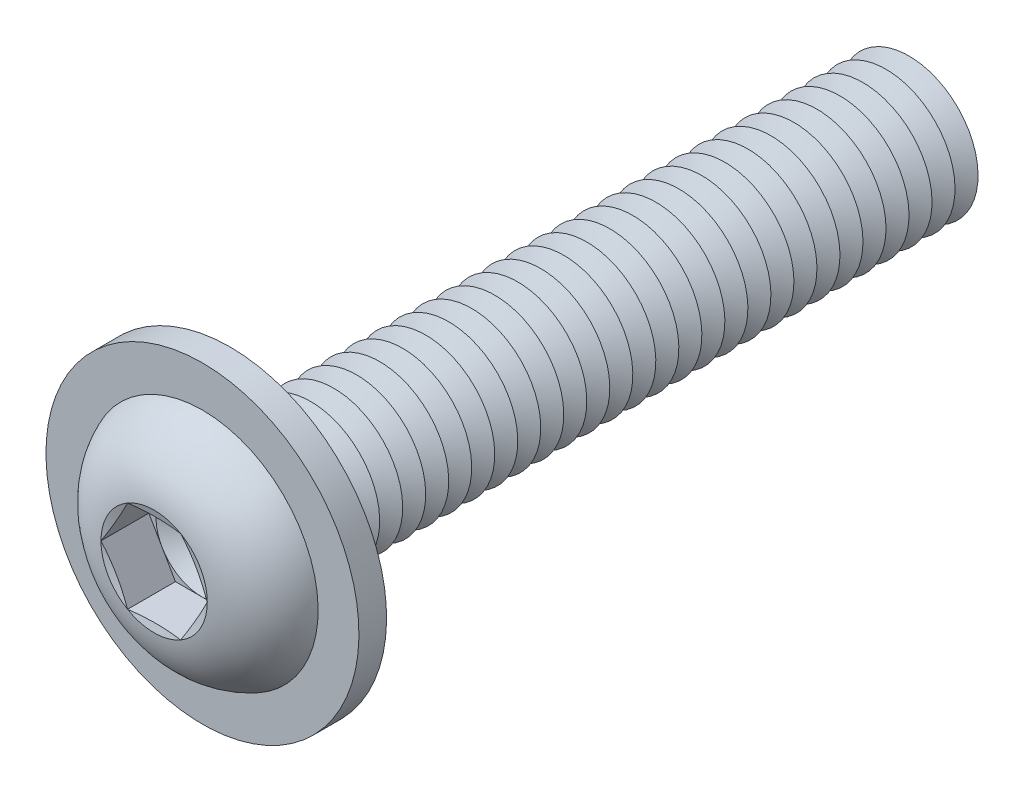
ISO-10303-21;
HEADER;
FILE_DESCRIPTION(('STEP AP214'),'2;1');
FILE_NAME('part.step','',(''),(''),'','','');
FILE_SCHEMA(('AUTOMOTIVE_DESIGN { 1 0 10303 214 1 1 1 1 }'));
ENDSEC;
DATA;
#1=APPLICATION_CONTEXT('core data for automotive mechanical design processes');
#2=APPLICATION_PROTOCOL_DEFINITION('international standard','automotive_design',2000,#1);
#3=PRODUCT_CONTEXT('',#1,'mechanical');
#4=PRODUCT('Part','Part','',(#3));
#5=PRODUCT_RELATED_PRODUCT_CATEGORY('part','',(#4));
#6=PRODUCT_DEFINITION_FORMATION('','',#4);
#7=PRODUCT_DEFINITION_CONTEXT('part definition',#1,'design');
#8=PRODUCT_DEFINITION('design','',#6,#7);
#9=PRODUCT_DEFINITION_SHAPE('','',#8);
#10=(LENGTH_UNIT() NAMED_UNIT(*) SI_UNIT(.MILLI.,.METRE.));
#11=(NAMED_UNIT(*) PLANE_ANGLE_UNIT() SI_UNIT($,.RADIAN.));
#12=(NAMED_UNIT(*) SI_UNIT($,.STERADIAN.) SOLID_ANGLE_UNIT());
#13=UNCERTAINTY_MEASURE_WITH_UNIT(LENGTH_MEASURE(1.E-05),#10,'distance_accuracy_value','');
#14=(GEOMETRIC_REPRESENTATION_CONTEXT(3) GLOBAL_UNCERTAINTY_ASSIGNED_CONTEXT((#13)) GLOBAL_UNIT_ASSIGNED_CONTEXT((#10,
#11,#12)) REPRESENTATION_CONTEXT('',''));
#15=CARTESIAN_POINT('',(0.,0.,0.));
#16=DIRECTION('',(0.,0.,1.));
#17=DIRECTION('',(1.,0.,0.));
#18=AXIS2_PLACEMENT_3D('',#15,#16,#17);
#19=CARTESIAN_POINT('',(0.,0.,-26.5));
#20=DIRECTION('',(0.,0.,1.));
#21=DIRECTION('',(0.,-1.,0.));
#22=AXIS2_PLACEMENT_3D('',#19,#20,#21);
#23=CONICAL_SURFACE('',#22,2.99999999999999,1.0471975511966);
#24=CARTESIAN_POINT('',(0.,0.,-27.));
#25=DIRECTION('',(0.,0.,1.));
#26=DIRECTION('',(0.,-1.,0.));
#27=AXIS2_PLACEMENT_3D('',#24,#25,#26);
#28=CIRCLE('',#27,2.13397459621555);
#29=CARTESIAN_POINT('',(0.,-2.13397459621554,-27.));
#30=VERTEX_POINT('',#29);
#31=EDGE_CURVE('E449',#30,#30,#28,.T.);
#32=ORIENTED_EDGE('',*,*,#31,.T.);
#33=EDGE_LOOP('',(#32));
#34=FACE_BOUND('',#33,.T.);
#35=CARTESIAN_POINT('',(0.,0.,-26.5));
#36=DIRECTION('',(0.,0.,1.));
#37=DIRECTION('',(0.,-1.,0.));
#38=AXIS2_PLACEMENT_3D('',#35,#36,#37);
#39=CIRCLE('',#38,2.99999999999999);
#40=CARTESIAN_POINT('',(0.,-2.99999999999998,-26.5));
#41=VERTEX_POINT('',#40);
#42=EDGE_CURVE('E445',#41,#41,#39,.T.);
#43=ORIENTED_EDGE('',*,*,#42,.F.);
#44=EDGE_LOOP('',(#43));
#45=FACE_BOUND('',#44,.T.);
#46=ADVANCED_FACE('F39',(#34,#45),#23,.T.);
#47=CARTESIAN_POINT('',(0.,0.,-27.));
#48=DIRECTION('',(0.,0.,-1.));
#49=DIRECTION('',(0.,1.,0.));
#50=AXIS2_PLACEMENT_3D('',#47,#48,#49);
#51=CONICAL_SURFACE('',#50,2.13397459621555,1.0471975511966);
#52=CARTESIAN_POINT('',(0.,0.,-27.5));
#53=DIRECTION('',(0.,0.,1.));
#54=DIRECTION('',(0.,-1.,0.));
#55=AXIS2_PLACEMENT_3D('',#52,#53,#54);
#56=CIRCLE('',#55,2.99999999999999);
#57=CARTESIAN_POINT('',(0.,-2.99999999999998,-27.5));
#58=VERTEX_POINT('',#57);
#59=EDGE_CURVE('E453',#58,#58,#56,.T.);
#60=ORIENTED_EDGE('',*,*,#59,.T.);
#61=EDGE_LOOP('',(#60));
#62=FACE_BOUND('',#61,.T.);
#63=ORIENTED_EDGE('',*,*,#31,.F.);
#64=EDGE_LOOP('',(#63));
#65=FACE_BOUND('',#64,.T.);
#66=ADVANCED_FACE('F570',(#62,#65),#51,.T.);
#67=CARTESIAN_POINT('',(0.,3.,-30.));
#68=DIRECTION('',(0.,0.,-1.));
#69=DIRECTION('',(0.,1.,0.));
#70=AXIS2_PLACEMENT_3D('',#67,#68,#69);
#71=PLANE('',#70);
#72=CARTESIAN_POINT('',(0.,0.,-30.));
#73=DIRECTION('',(0.,0.,1.));
#74=DIRECTION('',(0.,-1.,0.));
#75=AXIS2_PLACEMENT_3D('',#72,#73,#74);
#76=CIRCLE('',#75,2.13397459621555);
#77=CARTESIAN_POINT('',(0.,-2.13397459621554,-30.));
#78=VERTEX_POINT('',#77);
#79=EDGE_CURVE('E473',#78,#78,#76,.T.);
#80=ORIENTED_EDGE('',*,*,#79,.F.);
#81=EDGE_LOOP('',(#80));
#82=FACE_BOUND('',#81,.T.);
#83=ADVANCED_FACE('F576',(#82),#71,.T.);
#84=CARTESIAN_POINT('',(0.,0.,-29.5));
#85=DIRECTION('',(0.,0.,1.));
#86=DIRECTION('',(0.,-1.,0.));
#87=AXIS2_PLACEMENT_3D('',#84,#85,#86);
#88=CONICAL_SURFACE('',#87,2.99999999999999,1.0471975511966);
#89=ORIENTED_EDGE('',*,*,#79,.T.);
#90=EDGE_LOOP('',(#89));
#91=FACE_BOUND('',#90,.T.);
#92=CARTESIAN_POINT('',(0.,0.,-29.5));
#93=DIRECTION('',(0.,0.,1.));
#94=DIRECTION('',(0.,-1.,0.));
#95=AXIS2_PLACEMENT_3D('',#92,#93,#94);
#96=CIRCLE('',#95,2.99999999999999);
#97=CARTESIAN_POINT('',(0.,-2.99999999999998,-29.5));
#98=VERTEX_POINT('',#97);
#99=EDGE_CURVE('E469',#98,#98,#96,.T.);
#100=ORIENTED_EDGE('',*,*,#99,.F.);
#101=EDGE_LOOP('',(#100));
#102=FACE_BOUND('',#101,.T.);
#103=ADVANCED_FACE('F595',(#91,#102),#88,.T.);
#104=CARTESIAN_POINT('',(0.,0.,-29.));
#105=DIRECTION('',(0.,0.,-1.));
#106=DIRECTION('',(0.,1.,0.));
#107=AXIS2_PLACEMENT_3D('',#104,#105,#106);
#108=CONICAL_SURFACE('',#107,2.13397459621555,1.0471975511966);
#109=ORIENTED_EDGE('',*,*,#99,.T.);
#110=EDGE_LOOP('',(#109));
#111=FACE_BOUND('',#110,.T.);
#112=CARTESIAN_POINT('',(0.,0.,-29.));
#113=DIRECTION('',(0.,0.,1.));
#114=DIRECTION('',(0.,-1.,0.));
#115=AXIS2_PLACEMENT_3D('',#112,#113,#114);
#116=CIRCLE('',#115,2.13397459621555);
#117=CARTESIAN_POINT('',(0.,-2.13397459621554,-29.));
#118=VERTEX_POINT('',#117);
#119=EDGE_CURVE('E465',#118,#118,#116,.T.);
#120=ORIENTED_EDGE('',*,*,#119,.F.);
#121=EDGE_LOOP('',(#120));
#122=FACE_BOUND('',#121,.T.);
#123=ADVANCED_FACE('F592',(#111,#122),#108,.T.);
#124=CARTESIAN_POINT('',(0.,0.,-28.5));
#125=DIRECTION('',(0.,0.,1.));
#126=DIRECTION('',(0.,-1.,0.));
#127=AXIS2_PLACEMENT_3D('',#124,#125,#126);
#128=CONICAL_SURFACE('',#127,2.99999999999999,1.0471975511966);
#129=ORIENTED_EDGE('',*,*,#119,.T.);
#130=EDGE_LOOP('',(#129));
#131=FACE_BOUND('',#130,.T.);
#132=CARTESIAN_POINT('',(0.,0.,-28.5));
#133=DIRECTION('',(0.,0.,1.));
#134=DIRECTION('',(0.,-1.,0.));
#135=AXIS2_PLACEMENT_3D('',#132,#133,#134);
#136=CIRCLE('',#135,2.99999999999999);
#137=CARTESIAN_POINT('',(0.,-2.99999999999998,-28.5));
#138=VERTEX_POINT('',#137);
#139=EDGE_CURVE('E461',#138,#138,#136,.T.);
#140=ORIENTED_EDGE('',*,*,#139,.F.);
#141=EDGE_LOOP('',(#140));
#142=FACE_BOUND('',#141,.T.);
#143=ADVANCED_FACE('F586',(#131,#142),#128,.T.);
#144=CARTESIAN_POINT('',(0.,0.,-28.));
#145=DIRECTION('',(0.,0.,-1.));
#146=DIRECTION('',(0.,1.,0.));
#147=AXIS2_PLACEMENT_3D('',#144,#145,#146);
#148=CONICAL_SURFACE('',#147,2.13397459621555,1.0471975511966);
#149=ORIENTED_EDGE('',*,*,#139,.T.);
#150=EDGE_LOOP('',(#149));
#151=FACE_BOUND('',#150,.T.);
#152=CARTESIAN_POINT('',(0.,0.,-28.));
#153=DIRECTION('',(0.,0.,1.));
#154=DIRECTION('',(0.,-1.,0.));
#155=AXIS2_PLACEMENT_3D('',#152,#153,#154);
#156=CIRCLE('',#155,2.13397459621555);
#157=CARTESIAN_POINT('',(0.,-2.13397459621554,-28.));
#158=VERTEX_POINT('',#157);
#159=EDGE_CURVE('E457',#158,#158,#156,.T.);
#160=ORIENTED_EDGE('',*,*,#159,.F.);
#161=EDGE_LOOP('',(#160));
#162=FACE_BOUND('',#161,.T.);
#163=ADVANCED_FACE('F582',(#151,#162),#148,.T.);
#164=CARTESIAN_POINT('',(0.,0.,-27.5));
#165=DIRECTION('',(0.,0.,1.));
#166=DIRECTION('',(0.,-1.,0.));
#167=AXIS2_PLACEMENT_3D('',#164,#165,#166);
#168=CONICAL_SURFACE('',#167,2.99999999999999,1.0471975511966);
#169=ORIENTED_EDGE('',*,*,#159,.T.);
#170=EDGE_LOOP('',(#169));
#171=FACE_BOUND('',#170,.T.);
#172=ORIENTED_EDGE('',*,*,#59,.F.);
#173=EDGE_LOOP('',(#172));
#174=FACE_BOUND('',#173,.T.);
#175=ADVANCED_FACE('F585',(#171,#174),#168,.T.);
#176=CARTESIAN_POINT('',(0.,0.,-25.5));
#177=DIRECTION('',(0.,0.,1.));
#178=DIRECTION('',(0.,-1.,0.));
#179=AXIS2_PLACEMENT_3D('',#176,#177,#178);
#180=CONICAL_SURFACE('',#179,2.99999999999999,1.0471975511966);
#181=CARTESIAN_POINT('',(0.,0.,-26.));
#182=DIRECTION('',(0.,0.,1.));
#183=DIRECTION('',(0.,-1.,0.));
#184=AXIS2_PLACEMENT_3D('',#181,#182,#183);
#185=CIRCLE('',#184,2.13397459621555);
#186=CARTESIAN_POINT('',(0.,-2.13397459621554,-26.));
#187=VERTEX_POINT('',#186);
#188=EDGE_CURVE('E441',#187,#187,#185,.T.);
#189=ORIENTED_EDGE('',*,*,#188,.T.);
#190=EDGE_LOOP('',(#189));
#191=FACE_BOUND('',#190,.T.);
#192=CARTESIAN_POINT('',(0.,0.,-25.5));
#193=DIRECTION('',(0.,0.,1.));
#194=DIRECTION('',(0.,-1.,0.));
#195=AXIS2_PLACEMENT_3D('',#192,#193,#194);
#196=CIRCLE('',#195,2.99999999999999);
#197=CARTESIAN_POINT('',(0.,-2.99999999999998,-25.5));
#198=VERTEX_POINT('',#197);
#199=EDGE_CURVE('E437',#198,#198,#196,.T.);
#200=ORIENTED_EDGE('',*,*,#199,.F.);
#201=EDGE_LOOP('',(#200));
#202=FACE_BOUND('',#201,.T.);
#203=ADVANCED_FACE('F590',(#191,#202),#180,.T.);
#204=CARTESIAN_POINT('',(0.,0.,-26.));
#205=DIRECTION('',(0.,0.,-1.));
#206=DIRECTION('',(0.,1.,0.));
#207=AXIS2_PLACEMENT_3D('',#204,#205,#206);
#208=CONICAL_SURFACE('',#207,2.13397459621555,1.0471975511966);
#209=ORIENTED_EDGE('',*,*,#42,.T.);
#210=EDGE_LOOP('',(#209));
#211=FACE_BOUND('',#210,.T.);
#212=ORIENTED_EDGE('',*,*,#188,.F.);
#213=EDGE_LOOP('',(#212));
#214=FACE_BOUND('',#213,.T.);
#215=ADVANCED_FACE('F641',(#211,#214),#208,.T.);
#216=CARTESIAN_POINT('',(0.,0.,-24.5));
#217=DIRECTION('',(0.,0.,1.));
#218=DIRECTION('',(0.,-1.,0.));
#219=AXIS2_PLACEMENT_3D('',#216,#217,#218);
#220=CONICAL_SURFACE('',#219,2.99999999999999,1.0471975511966);
#221=CARTESIAN_POINT('',(0.,0.,-25.));
#222=DIRECTION('',(0.,0.,1.));
#223=DIRECTION('',(0.,-1.,0.));
#224=AXIS2_PLACEMENT_3D('',#221,#222,#223);
#225=CIRCLE('',#224,2.13397459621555);
#226=CARTESIAN_POINT('',(0.,-2.13397459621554,-25.));
#227=VERTEX_POINT('',#226);
#228=EDGE_CURVE('E433',#227,#227,#225,.T.);
#229=ORIENTED_EDGE('',*,*,#228,.T.);
#230=EDGE_LOOP('',(#229));
#231=FACE_BOUND('',#230,.T.);
#232=CARTESIAN_POINT('',(0.,0.,-24.5));
#233=DIRECTION('',(0.,0.,1.));
#234=DIRECTION('',(0.,-1.,0.));
#235=AXIS2_PLACEMENT_3D('',#232,#233,#234);
#236=CIRCLE('',#235,2.99999999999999);
#237=CARTESIAN_POINT('',(0.,-2.99999999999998,-24.5));
#238=VERTEX_POINT('',#237);
#239=EDGE_CURVE('E429',#238,#238,#236,.T.);
#240=ORIENTED_EDGE('',*,*,#239,.F.);
#241=EDGE_LOOP('',(#240));
#242=FACE_BOUND('',#241,.T.);
#243=ADVANCED_FACE('F647',(#231,#242),#220,.T.);
#244=CARTESIAN_POINT('',(0.,0.,-25.));
#245=DIRECTION('',(0.,0.,-1.));
#246=DIRECTION('',(0.,1.,0.));
#247=AXIS2_PLACEMENT_3D('',#244,#245,#246);
#248=CONICAL_SURFACE('',#247,2.13397459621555,1.0471975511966);
#249=ORIENTED_EDGE('',*,*,#199,.T.);
#250=EDGE_LOOP('',(#249));
#251=FACE_BOUND('',#250,.T.);
#252=ORIENTED_EDGE('',*,*,#228,.F.);
#253=EDGE_LOOP('',(#252));
#254=FACE_BOUND('',#253,.T.);
#255=ADVANCED_FACE('F654',(#251,#254),#248,.T.);
#256=CARTESIAN_POINT('',(0.,0.,-23.5));
#257=DIRECTION('',(0.,0.,1.));
#258=DIRECTION('',(0.,-1.,0.));
#259=AXIS2_PLACEMENT_3D('',#256,#257,#258);
#260=CONICAL_SURFACE('',#259,2.99999999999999,1.0471975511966);
#261=CARTESIAN_POINT('',(0.,0.,-24.));
#262=DIRECTION('',(0.,0.,1.));
#263=DIRECTION('',(0.,-1.,0.));
#264=AXIS2_PLACEMENT_3D('',#261,#262,#263);
#265=CIRCLE('',#264,2.13397459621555);
#266=CARTESIAN_POINT('',(0.,-2.13397459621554,-24.));
#267=VERTEX_POINT('',#266);
#268=EDGE_CURVE('E425',#267,#267,#265,.T.);
#269=ORIENTED_EDGE('',*,*,#268,.T.);
#270=EDGE_LOOP('',(#269));
#271=FACE_BOUND('',#270,.T.);
#272=CARTESIAN_POINT('',(0.,0.,-23.5));
#273=DIRECTION('',(0.,0.,1.));
#274=DIRECTION('',(0.,-1.,0.));
#275=AXIS2_PLACEMENT_3D('',#272,#273,#274);
#276=CIRCLE('',#275,2.99999999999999);
#277=CARTESIAN_POINT('',(0.,-2.99999999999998,-23.5));
#278=VERTEX_POINT('',#277);
#279=EDGE_CURVE('E421',#278,#278,#276,.T.);
#280=ORIENTED_EDGE('',*,*,#279,.F.);
#281=EDGE_LOOP('',(#280));
#282=FACE_BOUND('',#281,.T.);
#283=ADVANCED_FACE('F661',(#271,#282),#260,.T.);
#284=CARTESIAN_POINT('',(0.,0.,-24.));
#285=DIRECTION('',(0.,0.,-1.));
#286=DIRECTION('',(0.,1.,0.));
#287=AXIS2_PLACEMENT_3D('',#284,#285,#286);
#288=CONICAL_SURFACE('',#287,2.13397459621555,1.0471975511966);
#289=ORIENTED_EDGE('',*,*,#239,.T.);
#290=EDGE_LOOP('',(#289));
#291=FACE_BOUND('',#290,.T.);
#292=ORIENTED_EDGE('',*,*,#268,.F.);
#293=EDGE_LOOP('',(#292));
#294=FACE_BOUND('',#293,.T.);
#295=ADVANCED_FACE('F668',(#291,#294),#288,.T.);
#296=CARTESIAN_POINT('',(0.,0.,-22.5));
#297=DIRECTION('',(0.,0.,1.));
#298=DIRECTION('',(0.,-1.,0.));
#299=AXIS2_PLACEMENT_3D('',#296,#297,#298);
#300=CONICAL_SURFACE('',#299,2.99999999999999,1.0471975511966);
#301=CARTESIAN_POINT('',(0.,0.,-23.));
#302=DIRECTION('',(0.,0.,1.));
#303=DIRECTION('',(0.,-1.,0.));
#304=AXIS2_PLACEMENT_3D('',#301,#302,#303);
#305=CIRCLE('',#304,2.13397459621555);
#306=CARTESIAN_POINT('',(0.,-2.13397459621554,-23.));
#307=VERTEX_POINT('',#306);
#308=EDGE_CURVE('E417',#307,#307,#305,.T.);
#309=ORIENTED_EDGE('',*,*,#308,.T.);
#310=EDGE_LOOP('',(#309));
#311=FACE_BOUND('',#310,.T.);
#312=CARTESIAN_POINT('',(0.,0.,-22.5));
#313=DIRECTION('',(0.,0.,1.));
#314=DIRECTION('',(0.,-1.,0.));
#315=AXIS2_PLACEMENT_3D('',#312,#313,#314);
#316=CIRCLE('',#315,2.99999999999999);
#317=CARTESIAN_POINT('',(0.,-2.99999999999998,-22.5));
#318=VERTEX_POINT('',#317);
#319=EDGE_CURVE('E413',#318,#318,#316,.T.);
#320=ORIENTED_EDGE('',*,*,#319,.F.);
#321=EDGE_LOOP('',(#320));
#322=FACE_BOUND('',#321,.T.);
#323=ADVANCED_FACE('F675',(#311,#322),#300,.T.);
#324=CARTESIAN_POINT('',(0.,0.,-23.));
#325=DIRECTION('',(0.,0.,-1.));
#326=DIRECTION('',(0.,1.,0.));
#327=AXIS2_PLACEMENT_3D('',#324,#325,#326);
#328=CONICAL_SURFACE('',#327,2.13397459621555,1.0471975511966);
#329=ORIENTED_EDGE('',*,*,#279,.T.);
#330=EDGE_LOOP('',(#329));
#331=FACE_BOUND('',#330,.T.);
#332=ORIENTED_EDGE('',*,*,#308,.F.);
#333=EDGE_LOOP('',(#332));
#334=FACE_BOUND('',#333,.T.);
#335=ADVANCED_FACE('F682',(#331,#334),#328,.T.);
#336=CARTESIAN_POINT('',(0.,0.,-21.5));
#337=DIRECTION('',(0.,0.,1.));
#338=DIRECTION('',(0.,-1.,0.));
#339=AXIS2_PLACEMENT_3D('',#336,#337,#338);
#340=CONICAL_SURFACE('',#339,2.99999999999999,1.0471975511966);
#341=CARTESIAN_POINT('',(0.,0.,-22.));
#342=DIRECTION('',(0.,0.,1.));
#343=DIRECTION('',(0.,-1.,0.));
#344=AXIS2_PLACEMENT_3D('',#341,#342,#343);
#345=CIRCLE('',#344,2.13397459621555);
#346=CARTESIAN_POINT('',(0.,-2.13397459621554,-22.));
#347=VERTEX_POINT('',#346);
#348=EDGE_CURVE('E409',#347,#347,#345,.T.);
#349=ORIENTED_EDGE('',*,*,#348,.T.);
#350=EDGE_LOOP('',(#349));
#351=FACE_BOUND('',#350,.T.);
#352=CARTESIAN_POINT('',(0.,0.,-21.5));
#353=DIRECTION('',(0.,0.,1.));
#354=DIRECTION('',(0.,-1.,0.));
#355=AXIS2_PLACEMENT_3D('',#352,#353,#354);
#356=CIRCLE('',#355,2.99999999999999);
#357=CARTESIAN_POINT('',(0.,-2.99999999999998,-21.5));
#358=VERTEX_POINT('',#357);
#359=EDGE_CURVE('E405',#358,#358,#356,.T.);
#360=ORIENTED_EDGE('',*,*,#359,.F.);
#361=EDGE_LOOP('',(#360));
#362=FACE_BOUND('',#361,.T.);
#363=ADVANCED_FACE('F689',(#351,#362),#340,.T.);
#364=CARTESIAN_POINT('',(0.,0.,-22.));
#365=DIRECTION('',(0.,0.,-1.));
#366=DIRECTION('',(0.,1.,0.));
#367=AXIS2_PLACEMENT_3D('',#364,#365,#366);
#368=CONICAL_SURFACE('',#367,2.13397459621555,1.0471975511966);
#369=ORIENTED_EDGE('',*,*,#319,.T.);
#370=EDGE_LOOP('',(#369));
#371=FACE_BOUND('',#370,.T.);
#372=ORIENTED_EDGE('',*,*,#348,.F.);
#373=EDGE_LOOP('',(#372));
#374=FACE_BOUND('',#373,.T.);
#375=ADVANCED_FACE('F696',(#371,#374),#368,.T.);
#376=CARTESIAN_POINT('',(0.,0.,-20.5));
#377=DIRECTION('',(0.,0.,1.));
#378=DIRECTION('',(0.,-1.,0.));
#379=AXIS2_PLACEMENT_3D('',#376,#377,#378);
#380=CONICAL_SURFACE('',#379,2.99999999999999,1.0471975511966);
#381=CARTESIAN_POINT('',(0.,0.,-21.));
#382=DIRECTION('',(0.,0.,1.));
#383=DIRECTION('',(0.,-1.,0.));
#384=AXIS2_PLACEMENT_3D('',#381,#382,#383);
#385=CIRCLE('',#384,2.13397459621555);
#386=CARTESIAN_POINT('',(0.,-2.13397459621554,-21.));
#387=VERTEX_POINT('',#386);
#388=EDGE_CURVE('E401',#387,#387,#385,.T.);
#389=ORIENTED_EDGE('',*,*,#388,.T.);
#390=EDGE_LOOP('',(#389));
#391=FACE_BOUND('',#390,.T.);
#392=CARTESIAN_POINT('',(0.,0.,-20.5));
#393=DIRECTION('',(0.,0.,1.));
#394=DIRECTION('',(0.,-1.,0.));
#395=AXIS2_PLACEMENT_3D('',#392,#393,#394);
#396=CIRCLE('',#395,2.99999999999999);
#397=CARTESIAN_POINT('',(0.,-2.99999999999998,-20.5));
#398=VERTEX_POINT('',#397);
#399=EDGE_CURVE('E397',#398,#398,#396,.T.);
#400=ORIENTED_EDGE('',*,*,#399,.F.);
#401=EDGE_LOOP('',(#400));
#402=FACE_BOUND('',#401,.T.);
#403=ADVANCED_FACE('F703',(#391,#402),#380,.T.);
#404=CARTESIAN_POINT('',(0.,0.,-21.));
#405=DIRECTION('',(0.,0.,-1.));
#406=DIRECTION('',(0.,1.,0.));
#407=AXIS2_PLACEMENT_3D('',#404,#405,#406);
#408=CONICAL_SURFACE('',#407,2.13397459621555,1.0471975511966);
#409=ORIENTED_EDGE('',*,*,#359,.T.);
#410=EDGE_LOOP('',(#409));
#411=FACE_BOUND('',#410,.T.);
#412=ORIENTED_EDGE('',*,*,#388,.F.);
#413=EDGE_LOOP('',(#412));
#414=FACE_BOUND('',#413,.T.);
#415=ADVANCED_FACE('F710',(#411,#414),#408,.T.);
#416=CARTESIAN_POINT('',(0.,0.,-19.5));
#417=DIRECTION('',(0.,0.,1.));
#418=DIRECTION('',(0.,-1.,0.));
#419=AXIS2_PLACEMENT_3D('',#416,#417,#418);
#420=CONICAL_SURFACE('',#419,2.99999999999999,1.0471975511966);
#421=CARTESIAN_POINT('',(0.,0.,-20.));
#422=DIRECTION('',(0.,0.,1.));
#423=DIRECTION('',(0.,-1.,0.));
#424=AXIS2_PLACEMENT_3D('',#421,#422,#423);
#425=CIRCLE('',#424,2.13397459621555);
#426=CARTESIAN_POINT('',(0.,-2.13397459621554,-20.));
#427=VERTEX_POINT('',#426);
#428=EDGE_CURVE('E393',#427,#427,#425,.T.);
#429=ORIENTED_EDGE('',*,*,#428,.T.);
#430=EDGE_LOOP('',(#429));
#431=FACE_BOUND('',#430,.T.);
#432=CARTESIAN_POINT('',(0.,0.,-19.5));
#433=DIRECTION('',(0.,0.,1.));
#434=DIRECTION('',(0.,-1.,0.));
#435=AXIS2_PLACEMENT_3D('',#432,#433,#434);
#436=CIRCLE('',#435,2.99999999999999);
#437=CARTESIAN_POINT('',(0.,-2.99999999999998,-19.5));
#438=VERTEX_POINT('',#437);
#439=EDGE_CURVE('E389',#438,#438,#436,.T.);
#440=ORIENTED_EDGE('',*,*,#439,.F.);
#441=EDGE_LOOP('',(#440));
#442=FACE_BOUND('',#441,.T.);
#443=ADVANCED_FACE('F717',(#431,#442),#420,.T.);
#444=CARTESIAN_POINT('',(0.,0.,-20.));
#445=DIRECTION('',(0.,0.,-1.));
#446=DIRECTION('',(0.,1.,0.));
#447=AXIS2_PLACEMENT_3D('',#444,#445,#446);
#448=CONICAL_SURFACE('',#447,2.13397459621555,1.0471975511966);
#449=ORIENTED_EDGE('',*,*,#399,.T.);
#450=EDGE_LOOP('',(#449));
#451=FACE_BOUND('',#450,.T.);
#452=ORIENTED_EDGE('',*,*,#428,.F.);
#453=EDGE_LOOP('',(#452));
#454=FACE_BOUND('',#453,.T.);
#455=ADVANCED_FACE('F724',(#451,#454),#448,.T.);
#456=CARTESIAN_POINT('',(0.,0.,-18.5));
#457=DIRECTION('',(0.,0.,1.));
#458=DIRECTION('',(0.,-1.,0.));
#459=AXIS2_PLACEMENT_3D('',#456,#457,#458);
#460=CONICAL_SURFACE('',#459,2.99999999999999,1.0471975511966);
#461=CARTESIAN_POINT('',(0.,0.,-19.));
#462=DIRECTION('',(0.,0.,1.));
#463=DIRECTION('',(0.,-1.,0.));
#464=AXIS2_PLACEMENT_3D('',#461,#462,#463);
#465=CIRCLE('',#464,2.13397459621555);
#466=CARTESIAN_POINT('',(0.,-2.13397459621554,-19.));
#467=VERTEX_POINT('',#466);
#468=EDGE_CURVE('E385',#467,#467,#465,.T.);
#469=ORIENTED_EDGE('',*,*,#468,.T.);
#470=EDGE_LOOP('',(#469));
#471=FACE_BOUND('',#470,.T.);
#472=CARTESIAN_POINT('',(0.,0.,-18.5));
#473=DIRECTION('',(0.,0.,1.));
#474=DIRECTION('',(0.,-1.,0.));
#475=AXIS2_PLACEMENT_3D('',#472,#473,#474);
#476=CIRCLE('',#475,2.99999999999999);
#477=CARTESIAN_POINT('',(0.,-2.99999999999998,-18.5));
#478=VERTEX_POINT('',#477);
#479=EDGE_CURVE('E381',#478,#478,#476,.T.);
#480=ORIENTED_EDGE('',*,*,#479,.F.);
#481=EDGE_LOOP('',(#480));
#482=FACE_BOUND('',#481,.T.);
#483=ADVANCED_FACE('F731',(#471,#482),#460,.T.);
#484=CARTESIAN_POINT('',(0.,0.,-19.));
#485=DIRECTION('',(0.,0.,-1.));
#486=DIRECTION('',(0.,1.,0.));
#487=AXIS2_PLACEMENT_3D('',#484,#485,#486);
#488=CONICAL_SURFACE('',#487,2.13397459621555,1.0471975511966);
#489=ORIENTED_EDGE('',*,*,#439,.T.);
#490=EDGE_LOOP('',(#489));
#491=FACE_BOUND('',#490,.T.);
#492=ORIENTED_EDGE('',*,*,#468,.F.);
#493=EDGE_LOOP('',(#492));
#494=FACE_BOUND('',#493,.T.);
#495=ADVANCED_FACE('F738',(#491,#494),#488,.T.);
#496=CARTESIAN_POINT('',(0.,0.,-17.5));
#497=DIRECTION('',(0.,0.,1.));
#498=DIRECTION('',(0.,-1.,0.));
#499=AXIS2_PLACEMENT_3D('',#496,#497,#498);
#500=CONICAL_SURFACE('',#499,2.99999999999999,1.0471975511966);
#501=CARTESIAN_POINT('',(0.,0.,-18.));
#502=DIRECTION('',(0.,0.,1.));
#503=DIRECTION('',(0.,-1.,0.));
#504=AXIS2_PLACEMENT_3D('',#501,#502,#503);
#505=CIRCLE('',#504,2.13397459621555);
#506=CARTESIAN_POINT('',(0.,-2.13397459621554,-18.));
#507=VERTEX_POINT('',#506);
#508=EDGE_CURVE('E377',#507,#507,#505,.T.);
#509=ORIENTED_EDGE('',*,*,#508,.T.);
#510=EDGE_LOOP('',(#509));
#511=FACE_BOUND('',#510,.T.);
#512=CARTESIAN_POINT('',(0.,0.,-17.5));
#513=DIRECTION('',(0.,0.,1.));
#514=DIRECTION('',(0.,-1.,0.));
#515=AXIS2_PLACEMENT_3D('',#512,#513,#514);
#516=CIRCLE('',#515,2.99999999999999);
#517=CARTESIAN_POINT('',(0.,-2.99999999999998,-17.5));
#518=VERTEX_POINT('',#517);
#519=EDGE_CURVE('E373',#518,#518,#516,.T.);
#520=ORIENTED_EDGE('',*,*,#519,.F.);
#521=EDGE_LOOP('',(#520));
#522=FACE_BOUND('',#521,.T.);
#523=ADVANCED_FACE('F745',(#511,#522),#500,.T.);
#524=CARTESIAN_POINT('',(0.,0.,-18.));
#525=DIRECTION('',(0.,0.,-1.));
#526=DIRECTION('',(0.,1.,0.));
#527=AXIS2_PLACEMENT_3D('',#524,#525,#526);
#528=CONICAL_SURFACE('',#527,2.13397459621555,1.0471975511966);
#529=ORIENTED_EDGE('',*,*,#479,.T.);
#530=EDGE_LOOP('',(#529));
#531=FACE_BOUND('',#530,.T.);
#532=ORIENTED_EDGE('',*,*,#508,.F.);
#533=EDGE_LOOP('',(#532));
#534=FACE_BOUND('',#533,.T.);
#535=ADVANCED_FACE('F752',(#531,#534),#528,.T.);
#536=CARTESIAN_POINT('',(0.,0.,-16.5));
#537=DIRECTION('',(0.,0.,1.));
#538=DIRECTION('',(0.,-1.,0.));
#539=AXIS2_PLACEMENT_3D('',#536,#537,#538);
#540=CONICAL_SURFACE('',#539,2.99999999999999,1.0471975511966);
#541=CARTESIAN_POINT('',(0.,0.,-17.));
#542=DIRECTION('',(0.,0.,1.));
#543=DIRECTION('',(0.,-1.,0.));
#544=AXIS2_PLACEMENT_3D('',#541,#542,#543);
#545=CIRCLE('',#544,2.13397459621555);
#546=CARTESIAN_POINT('',(0.,-2.13397459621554,-17.));
#547=VERTEX_POINT('',#546);
#548=EDGE_CURVE('E369',#547,#547,#545,.T.);
#549=ORIENTED_EDGE('',*,*,#548,.T.);
#550=EDGE_LOOP('',(#549));
#551=FACE_BOUND('',#550,.T.);
#552=CARTESIAN_POINT('',(0.,0.,-16.5));
#553=DIRECTION('',(0.,0.,1.));
#554=DIRECTION('',(0.,-1.,0.));
#555=AXIS2_PLACEMENT_3D('',#552,#553,#554);
#556=CIRCLE('',#555,2.99999999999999);
#557=CARTESIAN_POINT('',(0.,-2.99999999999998,-16.5));
#558=VERTEX_POINT('',#557);
#559=EDGE_CURVE('E365',#558,#558,#556,.T.);
#560=ORIENTED_EDGE('',*,*,#559,.F.);
#561=EDGE_LOOP('',(#560));
#562=FACE_BOUND('',#561,.T.);
#563=ADVANCED_FACE('F759',(#551,#562),#540,.T.);
#564=CARTESIAN_POINT('',(0.,0.,-17.));
#565=DIRECTION('',(0.,0.,-1.));
#566=DIRECTION('',(0.,1.,0.));
#567=AXIS2_PLACEMENT_3D('',#564,#565,#566);
#568=CONICAL_SURFACE('',#567,2.13397459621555,1.0471975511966);
#569=ORIENTED_EDGE('',*,*,#519,.T.);
#570=EDGE_LOOP('',(#569));
#571=FACE_BOUND('',#570,.T.);
#572=ORIENTED_EDGE('',*,*,#548,.F.);
#573=EDGE_LOOP('',(#572));
#574=FACE_BOUND('',#573,.T.);
#575=ADVANCED_FACE('F766',(#571,#574),#568,.T.);
#576=CARTESIAN_POINT('',(0.,0.,-15.5));
#577=DIRECTION('',(0.,0.,1.));
#578=DIRECTION('',(0.,-1.,0.));
#579=AXIS2_PLACEMENT_3D('',#576,#577,#578);
#580=CONICAL_SURFACE('',#579,2.99999999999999,1.0471975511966);
#581=CARTESIAN_POINT('',(0.,0.,-16.));
#582=DIRECTION('',(0.,0.,1.));
#583=DIRECTION('',(0.,-1.,0.));
#584=AXIS2_PLACEMENT_3D('',#581,#582,#583);
#585=CIRCLE('',#584,2.13397459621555);
#586=CARTESIAN_POINT('',(0.,-2.13397459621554,-16.));
#587=VERTEX_POINT('',#586);
#588=EDGE_CURVE('E361',#587,#587,#585,.T.);
#589=ORIENTED_EDGE('',*,*,#588,.T.);
#590=EDGE_LOOP('',(#589));
#591=FACE_BOUND('',#590,.T.);
#592=CARTESIAN_POINT('',(0.,0.,-15.5));
#593=DIRECTION('',(0.,0.,1.));
#594=DIRECTION('',(0.,-1.,0.));
#595=AXIS2_PLACEMENT_3D('',#592,#593,#594);
#596=CIRCLE('',#595,2.99999999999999);
#597=CARTESIAN_POINT('',(0.,-2.99999999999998,-15.5));
#598=VERTEX_POINT('',#597);
#599=EDGE_CURVE('E357',#598,#598,#596,.T.);
#600=ORIENTED_EDGE('',*,*,#599,.F.);
#601=EDGE_LOOP('',(#600));
#602=FACE_BOUND('',#601,.T.);
#603=ADVANCED_FACE('F773',(#591,#602),#580,.T.);
#604=CARTESIAN_POINT('',(0.,0.,-16.));
#605=DIRECTION('',(0.,0.,-1.));
#606=DIRECTION('',(0.,1.,0.));
#607=AXIS2_PLACEMENT_3D('',#604,#605,#606);
#608=CONICAL_SURFACE('',#607,2.13397459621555,1.0471975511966);
#609=ORIENTED_EDGE('',*,*,#559,.T.);
#610=EDGE_LOOP('',(#609));
#611=FACE_BOUND('',#610,.T.);
#612=ORIENTED_EDGE('',*,*,#588,.F.);
#613=EDGE_LOOP('',(#612));
#614=FACE_BOUND('',#613,.T.);
#615=ADVANCED_FACE('F780',(#611,#614),#608,.T.);
#616=CARTESIAN_POINT('',(0.,0.,-14.5));
#617=DIRECTION('',(0.,0.,1.));
#618=DIRECTION('',(0.,-1.,0.));
#619=AXIS2_PLACEMENT_3D('',#616,#617,#618);
#620=CONICAL_SURFACE('',#619,2.99999999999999,1.0471975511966);
#621=CARTESIAN_POINT('',(0.,0.,-15.));
#622=DIRECTION('',(0.,0.,1.));
#623=DIRECTION('',(0.,-1.,0.));
#624=AXIS2_PLACEMENT_3D('',#621,#622,#623);
#625=CIRCLE('',#624,2.13397459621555);
#626=CARTESIAN_POINT('',(0.,-2.13397459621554,-15.));
#627=VERTEX_POINT('',#626);
#628=EDGE_CURVE('E353',#627,#627,#625,.T.);
#629=ORIENTED_EDGE('',*,*,#628,.T.);
#630=EDGE_LOOP('',(#629));
#631=FACE_BOUND('',#630,.T.);
#632=CARTESIAN_POINT('',(0.,0.,-14.5));
#633=DIRECTION('',(0.,0.,1.));
#634=DIRECTION('',(0.,-1.,0.));
#635=AXIS2_PLACEMENT_3D('',#632,#633,#634);
#636=CIRCLE('',#635,2.99999999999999);
#637=CARTESIAN_POINT('',(0.,-2.99999999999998,-14.5));
#638=VERTEX_POINT('',#637);
#639=EDGE_CURVE('E349',#638,#638,#636,.T.);
#640=ORIENTED_EDGE('',*,*,#639,.F.);
#641=EDGE_LOOP('',(#640));
#642=FACE_BOUND('',#641,.T.);
#643=ADVANCED_FACE('F787',(#631,#642),#620,.T.);
#644=CARTESIAN_POINT('',(0.,0.,-15.));
#645=DIRECTION('',(0.,0.,-1.));
#646=DIRECTION('',(0.,1.,0.));
#647=AXIS2_PLACEMENT_3D('',#644,#645,#646);
#648=CONICAL_SURFACE('',#647,2.13397459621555,1.0471975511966);
#649=ORIENTED_EDGE('',*,*,#599,.T.);
#650=EDGE_LOOP('',(#649));
#651=FACE_BOUND('',#650,.T.);
#652=ORIENTED_EDGE('',*,*,#628,.F.);
#653=EDGE_LOOP('',(#652));
#654=FACE_BOUND('',#653,.T.);
#655=ADVANCED_FACE('F794',(#651,#654),#648,.T.);
#656=CARTESIAN_POINT('',(0.,0.,-13.5));
#657=DIRECTION('',(0.,0.,1.));
#658=DIRECTION('',(0.,-1.,0.));
#659=AXIS2_PLACEMENT_3D('',#656,#657,#658);
#660=CONICAL_SURFACE('',#659,2.99999999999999,1.0471975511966);
#661=CARTESIAN_POINT('',(0.,0.,-14.));
#662=DIRECTION('',(0.,0.,1.));
#663=DIRECTION('',(0.,-1.,0.));
#664=AXIS2_PLACEMENT_3D('',#661,#662,#663);
#665=CIRCLE('',#664,2.13397459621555);
#666=CARTESIAN_POINT('',(0.,-2.13397459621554,-14.));
#667=VERTEX_POINT('',#666);
#668=EDGE_CURVE('E345',#667,#667,#665,.T.);
#669=ORIENTED_EDGE('',*,*,#668,.T.);
#670=EDGE_LOOP('',(#669));
#671=FACE_BOUND('',#670,.T.);
#672=CARTESIAN_POINT('',(0.,0.,-13.5));
#673=DIRECTION('',(0.,0.,1.));
#674=DIRECTION('',(0.,-1.,0.));
#675=AXIS2_PLACEMENT_3D('',#672,#673,#674);
#676=CIRCLE('',#675,2.99999999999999);
#677=CARTESIAN_POINT('',(0.,-2.99999999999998,-13.5));
#678=VERTEX_POINT('',#677);
#679=EDGE_CURVE('E341',#678,#678,#676,.T.);
#680=ORIENTED_EDGE('',*,*,#679,.F.);
#681=EDGE_LOOP('',(#680));
#682=FACE_BOUND('',#681,.T.);
#683=ADVANCED_FACE('F801',(#671,#682),#660,.T.);
#684=CARTESIAN_POINT('',(0.,0.,-14.));
#685=DIRECTION('',(0.,0.,-1.));
#686=DIRECTION('',(0.,1.,0.));
#687=AXIS2_PLACEMENT_3D('',#684,#685,#686);
#688=CONICAL_SURFACE('',#687,2.13397459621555,1.0471975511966);
#689=ORIENTED_EDGE('',*,*,#639,.T.);
#690=EDGE_LOOP('',(#689));
#691=FACE_BOUND('',#690,.T.);
#692=ORIENTED_EDGE('',*,*,#668,.F.);
#693=EDGE_LOOP('',(#692));
#694=FACE_BOUND('',#693,.T.);
#695=ADVANCED_FACE('F808',(#691,#694),#688,.T.);
#696=CARTESIAN_POINT('',(0.,0.,-12.5));
#697=DIRECTION('',(0.,0.,1.));
#698=DIRECTION('',(0.,-1.,0.));
#699=AXIS2_PLACEMENT_3D('',#696,#697,#698);
#700=CONICAL_SURFACE('',#699,2.99999999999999,1.0471975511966);
#701=CARTESIAN_POINT('',(0.,0.,-13.));
#702=DIRECTION('',(0.,0.,1.));
#703=DIRECTION('',(0.,-1.,0.));
#704=AXIS2_PLACEMENT_3D('',#701,#702,#703);
#705=CIRCLE('',#704,2.13397459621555);
#706=CARTESIAN_POINT('',(0.,-2.13397459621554,-13.));
#707=VERTEX_POINT('',#706);
#708=EDGE_CURVE('E337',#707,#707,#705,.T.);
#709=ORIENTED_EDGE('',*,*,#708,.T.);
#710=EDGE_LOOP('',(#709));
#711=FACE_BOUND('',#710,.T.);
#712=CARTESIAN_POINT('',(0.,0.,-12.5));
#713=DIRECTION('',(0.,0.,1.));
#714=DIRECTION('',(0.,-1.,0.));
#715=AXIS2_PLACEMENT_3D('',#712,#713,#714);
#716=CIRCLE('',#715,2.99999999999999);
#717=CARTESIAN_POINT('',(0.,-2.99999999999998,-12.5));
#718=VERTEX_POINT('',#717);
#719=EDGE_CURVE('E333',#718,#718,#716,.T.);
#720=ORIENTED_EDGE('',*,*,#719,.F.);
#721=EDGE_LOOP('',(#720));
#722=FACE_BOUND('',#721,.T.);
#723=ADVANCED_FACE('F815',(#711,#722),#700,.T.);
#724=CARTESIAN_POINT('',(0.,0.,-13.));
#725=DIRECTION('',(0.,0.,-1.));
#726=DIRECTION('',(0.,1.,0.));
#727=AXIS2_PLACEMENT_3D('',#724,#725,#726);
#728=CONICAL_SURFACE('',#727,2.13397459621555,1.0471975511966);
#729=ORIENTED_EDGE('',*,*,#679,.T.);
#730=EDGE_LOOP('',(#729));
#731=FACE_BOUND('',#730,.T.);
#732=ORIENTED_EDGE('',*,*,#708,.F.);
#733=EDGE_LOOP('',(#732));
#734=FACE_BOUND('',#733,.T.);
#735=ADVANCED_FACE('F822',(#731,#734),#728,.T.);
#736=CARTESIAN_POINT('',(0.,0.,-11.5));
#737=DIRECTION('',(0.,0.,1.));
#738=DIRECTION('',(0.,-1.,0.));
#739=AXIS2_PLACEMENT_3D('',#736,#737,#738);
#740=CONICAL_SURFACE('',#739,2.99999999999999,1.0471975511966);
#741=CARTESIAN_POINT('',(0.,0.,-12.));
#742=DIRECTION('',(0.,0.,1.));
#743=DIRECTION('',(0.,-1.,0.));
#744=AXIS2_PLACEMENT_3D('',#741,#742,#743);
#745=CIRCLE('',#744,2.13397459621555);
#746=CARTESIAN_POINT('',(0.,-2.13397459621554,-12.));
#747=VERTEX_POINT('',#746);
#748=EDGE_CURVE('E329',#747,#747,#745,.T.);
#749=ORIENTED_EDGE('',*,*,#748,.T.);
#750=EDGE_LOOP('',(#749));
#751=FACE_BOUND('',#750,.T.);
#752=CARTESIAN_POINT('',(0.,0.,-11.5));
#753=DIRECTION('',(0.,0.,1.));
#754=DIRECTION('',(0.,-1.,0.));
#755=AXIS2_PLACEMENT_3D('',#752,#753,#754);
#756=CIRCLE('',#755,2.99999999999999);
#757=CARTESIAN_POINT('',(0.,-2.99999999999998,-11.5));
#758=VERTEX_POINT('',#757);
#759=EDGE_CURVE('E325',#758,#758,#756,.T.);
#760=ORIENTED_EDGE('',*,*,#759,.F.);
#761=EDGE_LOOP('',(#760));
#762=FACE_BOUND('',#761,.T.);
#763=ADVANCED_FACE('F829',(#751,#762),#740,.T.);
#764=CARTESIAN_POINT('',(0.,0.,-12.));
#765=DIRECTION('',(0.,0.,-1.));
#766=DIRECTION('',(0.,1.,0.));
#767=AXIS2_PLACEMENT_3D('',#764,#765,#766);
#768=CONICAL_SURFACE('',#767,2.13397459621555,1.0471975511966);
#769=ORIENTED_EDGE('',*,*,#719,.T.);
#770=EDGE_LOOP('',(#769));
#771=FACE_BOUND('',#770,.T.);
#772=ORIENTED_EDGE('',*,*,#748,.F.);
#773=EDGE_LOOP('',(#772));
#774=FACE_BOUND('',#773,.T.);
#775=ADVANCED_FACE('F836',(#771,#774),#768,.T.);
#776=CARTESIAN_POINT('',(0.,0.,-10.5));
#777=DIRECTION('',(0.,0.,1.));
#778=DIRECTION('',(0.,-1.,0.));
#779=AXIS2_PLACEMENT_3D('',#776,#777,#778);
#780=CONICAL_SURFACE('',#779,2.99999999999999,1.0471975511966);
#781=CARTESIAN_POINT('',(0.,0.,-11.));
#782=DIRECTION('',(0.,0.,1.));
#783=DIRECTION('',(0.,-1.,0.));
#784=AXIS2_PLACEMENT_3D('',#781,#782,#783);
#785=CIRCLE('',#784,2.13397459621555);
#786=CARTESIAN_POINT('',(0.,-2.13397459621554,-11.));
#787=VERTEX_POINT('',#786);
#788=EDGE_CURVE('E321',#787,#787,#785,.T.);
#789=ORIENTED_EDGE('',*,*,#788,.T.);
#790=EDGE_LOOP('',(#789));
#791=FACE_BOUND('',#790,.T.);
#792=CARTESIAN_POINT('',(0.,0.,-10.5));
#793=DIRECTION('',(0.,0.,1.));
#794=DIRECTION('',(0.,-1.,0.));
#795=AXIS2_PLACEMENT_3D('',#792,#793,#794);
#796=CIRCLE('',#795,2.99999999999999);
#797=CARTESIAN_POINT('',(0.,-2.99999999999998,-10.5));
#798=VERTEX_POINT('',#797);
#799=EDGE_CURVE('E317',#798,#798,#796,.T.);
#800=ORIENTED_EDGE('',*,*,#799,.F.);
#801=EDGE_LOOP('',(#800));
#802=FACE_BOUND('',#801,.T.);
#803=ADVANCED_FACE('F843',(#791,#802),#780,.T.);
#804=CARTESIAN_POINT('',(0.,0.,-11.));
#805=DIRECTION('',(0.,0.,-1.));
#806=DIRECTION('',(0.,1.,0.));
#807=AXIS2_PLACEMENT_3D('',#804,#805,#806);
#808=CONICAL_SURFACE('',#807,2.13397459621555,1.0471975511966);
#809=ORIENTED_EDGE('',*,*,#759,.T.);
#810=EDGE_LOOP('',(#809));
#811=FACE_BOUND('',#810,.T.);
#812=ORIENTED_EDGE('',*,*,#788,.F.);
#813=EDGE_LOOP('',(#812));
#814=FACE_BOUND('',#813,.T.);
#815=ADVANCED_FACE('F850',(#811,#814),#808,.T.);
#816=CARTESIAN_POINT('',(0.,0.,-9.5));
#817=DIRECTION('',(0.,0.,1.));
#818=DIRECTION('',(0.,-1.,0.));
#819=AXIS2_PLACEMENT_3D('',#816,#817,#818);
#820=CONICAL_SURFACE('',#819,2.99999999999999,1.0471975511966);
#821=CARTESIAN_POINT('',(0.,0.,-10.));
#822=DIRECTION('',(0.,0.,1.));
#823=DIRECTION('',(0.,-1.,0.));
#824=AXIS2_PLACEMENT_3D('',#821,#822,#823);
#825=CIRCLE('',#824,2.13397459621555);
#826=CARTESIAN_POINT('',(0.,-2.13397459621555,-10.));
#827=VERTEX_POINT('',#826);
#828=EDGE_CURVE('E313',#827,#827,#825,.T.);
#829=ORIENTED_EDGE('',*,*,#828,.T.);
#830=EDGE_LOOP('',(#829));
#831=FACE_BOUND('',#830,.T.);
#832=CARTESIAN_POINT('',(0.,0.,-9.5));
#833=DIRECTION('',(0.,0.,1.));
#834=DIRECTION('',(0.,-1.,0.));
#835=AXIS2_PLACEMENT_3D('',#832,#833,#834);
#836=CIRCLE('',#835,2.99999999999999);
#837=CARTESIAN_POINT('',(0.,-2.99999999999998,-9.5));
#838=VERTEX_POINT('',#837);
#839=EDGE_CURVE('E309',#838,#838,#836,.T.);
#840=ORIENTED_EDGE('',*,*,#839,.F.);
#841=EDGE_LOOP('',(#840));
#842=FACE_BOUND('',#841,.T.);
#843=ADVANCED_FACE('F857',(#831,#842),#820,.T.);
#844=CARTESIAN_POINT('',(0.,0.,-10.));
#845=DIRECTION('',(0.,0.,-1.));
#846=DIRECTION('',(0.,1.,0.));
#847=AXIS2_PLACEMENT_3D('',#844,#845,#846);
#848=CONICAL_SURFACE('',#847,2.13397459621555,1.0471975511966);
#849=ORIENTED_EDGE('',*,*,#799,.T.);
#850=EDGE_LOOP('',(#849));
#851=FACE_BOUND('',#850,.T.);
#852=ORIENTED_EDGE('',*,*,#828,.F.);
#853=EDGE_LOOP('',(#852));
#854=FACE_BOUND('',#853,.T.);
#855=ADVANCED_FACE('F864',(#851,#854),#848,.T.);
#856=CARTESIAN_POINT('',(0.,0.,-8.5));
#857=DIRECTION('',(0.,0.,1.));
#858=DIRECTION('',(0.,-1.,0.));
#859=AXIS2_PLACEMENT_3D('',#856,#857,#858);
#860=CONICAL_SURFACE('',#859,2.99999999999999,1.0471975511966);
#861=CARTESIAN_POINT('',(0.,0.,-9.));
#862=DIRECTION('',(0.,0.,1.));
#863=DIRECTION('',(0.,-1.,0.));
#864=AXIS2_PLACEMENT_3D('',#861,#862,#863);
#865=CIRCLE('',#864,2.13397459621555);
#866=CARTESIAN_POINT('',(0.,-2.13397459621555,-9.));
#867=VERTEX_POINT('',#866);
#868=EDGE_CURVE('E305',#867,#867,#865,.T.);
#869=ORIENTED_EDGE('',*,*,#868,.T.);
#870=EDGE_LOOP('',(#869));
#871=FACE_BOUND('',#870,.T.);
#872=CARTESIAN_POINT('',(0.,0.,-8.5));
#873=DIRECTION('',(0.,0.,1.));
#874=DIRECTION('',(0.,-1.,0.));
#875=AXIS2_PLACEMENT_3D('',#872,#873,#874);
#876=CIRCLE('',#875,2.99999999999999);
#877=CARTESIAN_POINT('',(0.,-2.99999999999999,-8.50000000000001));
#878=VERTEX_POINT('',#877);
#879=EDGE_CURVE('E301',#878,#878,#876,.T.);
#880=ORIENTED_EDGE('',*,*,#879,.F.);
#881=EDGE_LOOP('',(#880));
#882=FACE_BOUND('',#881,.T.);
#883=ADVANCED_FACE('F871',(#871,#882),#860,.T.);
#884=CARTESIAN_POINT('',(0.,0.,-9.));
#885=DIRECTION('',(0.,0.,-1.));
#886=DIRECTION('',(0.,1.,0.));
#887=AXIS2_PLACEMENT_3D('',#884,#885,#886);
#888=CONICAL_SURFACE('',#887,2.13397459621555,1.0471975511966);
#889=ORIENTED_EDGE('',*,*,#839,.T.);
#890=EDGE_LOOP('',(#889));
#891=FACE_BOUND('',#890,.T.);
#892=ORIENTED_EDGE('',*,*,#868,.F.);
#893=EDGE_LOOP('',(#892));
#894=FACE_BOUND('',#893,.T.);
#895=ADVANCED_FACE('F878',(#891,#894),#888,.T.);
#896=CARTESIAN_POINT('',(0.,0.,-7.5));
#897=DIRECTION('',(0.,0.,1.));
#898=DIRECTION('',(0.,-1.,0.));
#899=AXIS2_PLACEMENT_3D('',#896,#897,#898);
#900=CONICAL_SURFACE('',#899,2.99999999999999,1.0471975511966);
#901=CARTESIAN_POINT('',(0.,0.,-8.));
#902=DIRECTION('',(0.,0.,1.));
#903=DIRECTION('',(0.,-1.,0.));
#904=AXIS2_PLACEMENT_3D('',#901,#902,#903);
#905=CIRCLE('',#904,2.13397459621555);
#906=CARTESIAN_POINT('',(0.,-2.13397459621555,-8.00000000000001));
#907=VERTEX_POINT('',#906);
#908=EDGE_CURVE('E297',#907,#907,#905,.T.);
#909=ORIENTED_EDGE('',*,*,#908,.T.);
#910=EDGE_LOOP('',(#909));
#911=FACE_BOUND('',#910,.T.);
#912=CARTESIAN_POINT('',(0.,0.,-7.5));
#913=DIRECTION('',(0.,0.,1.));
#914=DIRECTION('',(0.,-1.,0.));
#915=AXIS2_PLACEMENT_3D('',#912,#913,#914);
#916=CIRCLE('',#915,2.99999999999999);
#917=CARTESIAN_POINT('',(0.,-2.99999999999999,-7.50000000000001));
#918=VERTEX_POINT('',#917);
#919=EDGE_CURVE('E293',#918,#918,#916,.T.);
#920=ORIENTED_EDGE('',*,*,#919,.F.);
#921=EDGE_LOOP('',(#920));
#922=FACE_BOUND('',#921,.T.);
#923=ADVANCED_FACE('F885',(#911,#922),#900,.T.);
#924=CARTESIAN_POINT('',(0.,0.,-8.));
#925=DIRECTION('',(0.,0.,-1.));
#926=DIRECTION('',(0.,1.,0.));
#927=AXIS2_PLACEMENT_3D('',#924,#925,#926);
#928=CONICAL_SURFACE('',#927,2.13397459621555,1.0471975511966);
#929=ORIENTED_EDGE('',*,*,#879,.T.);
#930=EDGE_LOOP('',(#929));
#931=FACE_BOUND('',#930,.T.);
#932=ORIENTED_EDGE('',*,*,#908,.F.);
#933=EDGE_LOOP('',(#932));
#934=FACE_BOUND('',#933,.T.);
#935=ADVANCED_FACE('F892',(#931,#934),#928,.T.);
#936=CARTESIAN_POINT('',(0.,0.,-6.5));
#937=DIRECTION('',(0.,0.,1.));
#938=DIRECTION('',(0.,-1.,0.));
#939=AXIS2_PLACEMENT_3D('',#936,#937,#938);
#940=CONICAL_SURFACE('',#939,2.99999999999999,1.0471975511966);
#941=CARTESIAN_POINT('',(0.,0.,-7.));
#942=DIRECTION('',(0.,0.,1.));
#943=DIRECTION('',(0.,-1.,0.));
#944=AXIS2_PLACEMENT_3D('',#941,#942,#943);
#945=CIRCLE('',#944,2.13397459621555);
#946=CARTESIAN_POINT('',(0.,-2.13397459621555,-7.));
#947=VERTEX_POINT('',#946);
#948=EDGE_CURVE('E289',#947,#947,#945,.T.);
#949=ORIENTED_EDGE('',*,*,#948,.T.);
#950=EDGE_LOOP('',(#949));
#951=FACE_BOUND('',#950,.T.);
#952=CARTESIAN_POINT('',(0.,0.,-6.5));
#953=DIRECTION('',(0.,0.,1.));
#954=DIRECTION('',(0.,-1.,0.));
#955=AXIS2_PLACEMENT_3D('',#952,#953,#954);
#956=CIRCLE('',#955,2.99999999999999);
#957=CARTESIAN_POINT('',(0.,-2.99999999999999,-6.5));
#958=VERTEX_POINT('',#957);
#959=EDGE_CURVE('E285',#958,#958,#956,.T.);
#960=ORIENTED_EDGE('',*,*,#959,.F.);
#961=EDGE_LOOP('',(#960));
#962=FACE_BOUND('',#961,.T.);
#963=ADVANCED_FACE('F899',(#951,#962),#940,.T.);
#964=CARTESIAN_POINT('',(0.,0.,-7.));
#965=DIRECTION('',(0.,0.,-1.));
#966=DIRECTION('',(0.,1.,0.));
#967=AXIS2_PLACEMENT_3D('',#964,#965,#966);
#968=CONICAL_SURFACE('',#967,2.13397459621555,1.0471975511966);
#969=ORIENTED_EDGE('',*,*,#919,.T.);
#970=EDGE_LOOP('',(#969));
#971=FACE_BOUND('',#970,.T.);
#972=ORIENTED_EDGE('',*,*,#948,.F.);
#973=EDGE_LOOP('',(#972));
#974=FACE_BOUND('',#973,.T.);
#975=ADVANCED_FACE('F906',(#971,#974),#968,.T.);
#976=CARTESIAN_POINT('',(0.,0.,-5.5));
#977=DIRECTION('',(0.,0.,1.));
#978=DIRECTION('',(0.,-1.,0.));
#979=AXIS2_PLACEMENT_3D('',#976,#977,#978);
#980=CONICAL_SURFACE('',#979,2.99999999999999,1.0471975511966);
#981=CARTESIAN_POINT('',(0.,0.,-6.));
#982=DIRECTION('',(0.,0.,1.));
#983=DIRECTION('',(0.,-1.,0.));
#984=AXIS2_PLACEMENT_3D('',#981,#982,#983);
#985=CIRCLE('',#984,2.13397459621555);
#986=CARTESIAN_POINT('',(0.,-2.13397459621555,-6.));
#987=VERTEX_POINT('',#986);
#988=EDGE_CURVE('E281',#987,#987,#985,.T.);
#989=ORIENTED_EDGE('',*,*,#988,.T.);
#990=EDGE_LOOP('',(#989));
#991=FACE_BOUND('',#990,.T.);
#992=CARTESIAN_POINT('',(0.,0.,-5.5));
#993=DIRECTION('',(0.,0.,1.));
#994=DIRECTION('',(0.,-1.,0.));
#995=AXIS2_PLACEMENT_3D('',#992,#993,#994);
#996=CIRCLE('',#995,2.99999999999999);
#997=CARTESIAN_POINT('',(0.,-2.99999999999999,-5.5));
#998=VERTEX_POINT('',#997);
#999=EDGE_CURVE('E277',#998,#998,#996,.T.);
#1000=ORIENTED_EDGE('',*,*,#999,.F.);
#1001=EDGE_LOOP('',(#1000));
#1002=FACE_BOUND('',#1001,.T.);
#1003=ADVANCED_FACE('F913',(#991,#1002),#980,.T.);
#1004=CARTESIAN_POINT('',(0.,0.,-6.));
#1005=DIRECTION('',(0.,0.,-1.));
#1006=DIRECTION('',(0.,1.,0.));
#1007=AXIS2_PLACEMENT_3D('',#1004,#1005,#1006);
#1008=CONICAL_SURFACE('',#1007,2.13397459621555,1.0471975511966);
#1009=ORIENTED_EDGE('',*,*,#959,.T.);
#1010=EDGE_LOOP('',(#1009));
#1011=FACE_BOUND('',#1010,.T.);
#1012=ORIENTED_EDGE('',*,*,#988,.F.);
#1013=EDGE_LOOP('',(#1012));
#1014=FACE_BOUND('',#1013,.T.);
#1015=ADVANCED_FACE('F920',(#1011,#1014),#1008,.T.);
#1016=CARTESIAN_POINT('',(0.,0.,-4.5));
#1017=DIRECTION('',(0.,0.,1.));
#1018=DIRECTION('',(0.,-1.,0.));
#1019=AXIS2_PLACEMENT_3D('',#1016,#1017,#1018);
#1020=CONICAL_SURFACE('',#1019,2.99999999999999,1.0471975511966);
#1021=CARTESIAN_POINT('',(0.,0.,-5.));
#1022=DIRECTION('',(0.,0.,1.));
#1023=DIRECTION('',(0.,-1.,0.));
#1024=AXIS2_PLACEMENT_3D('',#1021,#1022,#1023);
#1025=CIRCLE('',#1024,2.13397459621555);
#1026=CARTESIAN_POINT('',(0.,-2.13397459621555,-5.));
#1027=VERTEX_POINT('',#1026);
#1028=EDGE_CURVE('E273',#1027,#1027,#1025,.T.);
#1029=ORIENTED_EDGE('',*,*,#1028,.T.);
#1030=EDGE_LOOP('',(#1029));
#1031=FACE_BOUND('',#1030,.T.);
#1032=CARTESIAN_POINT('',(0.,0.,-4.5));
#1033=DIRECTION('',(0.,0.,1.));
#1034=DIRECTION('',(0.,-1.,0.));
#1035=AXIS2_PLACEMENT_3D('',#1032,#1033,#1034);
#1036=CIRCLE('',#1035,2.99999999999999);
#1037=CARTESIAN_POINT('',(0.,-2.99999999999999,-4.5));
#1038=VERTEX_POINT('',#1037);
#1039=EDGE_CURVE('E269',#1038,#1038,#1036,.T.);
#1040=ORIENTED_EDGE('',*,*,#1039,.F.);
#1041=EDGE_LOOP('',(#1040));
#1042=FACE_BOUND('',#1041,.T.);
#1043=ADVANCED_FACE('F927',(#1031,#1042),#1020,.T.);
#1044=CARTESIAN_POINT('',(0.,0.,-5.));
#1045=DIRECTION('',(0.,0.,-1.));
#1046=DIRECTION('',(0.,1.,0.));
#1047=AXIS2_PLACEMENT_3D('',#1044,#1045,#1046);
#1048=CONICAL_SURFACE('',#1047,2.13397459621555,1.0471975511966);
#1049=ORIENTED_EDGE('',*,*,#999,.T.);
#1050=EDGE_LOOP('',(#1049));
#1051=FACE_BOUND('',#1050,.T.);
#1052=ORIENTED_EDGE('',*,*,#1028,.F.);
#1053=EDGE_LOOP('',(#1052));
#1054=FACE_BOUND('',#1053,.T.);
#1055=ADVANCED_FACE('F934',(#1051,#1054),#1048,.T.);
#1056=CARTESIAN_POINT('',(0.,0.,-3.5));
#1057=DIRECTION('',(0.,0.,1.));
#1058=DIRECTION('',(0.,-1.,0.));
#1059=AXIS2_PLACEMENT_3D('',#1056,#1057,#1058);
#1060=CONICAL_SURFACE('',#1059,2.99999999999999,1.0471975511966);
#1061=CARTESIAN_POINT('',(0.,0.,-4.));
#1062=DIRECTION('',(0.,0.,1.));
#1063=DIRECTION('',(0.,-1.,0.));
#1064=AXIS2_PLACEMENT_3D('',#1061,#1062,#1063);
#1065=CIRCLE('',#1064,2.13397459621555);
#1066=CARTESIAN_POINT('',(0.,-2.13397459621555,-4.));
#1067=VERTEX_POINT('',#1066);
#1068=EDGE_CURVE('E265',#1067,#1067,#1065,.T.);
#1069=ORIENTED_EDGE('',*,*,#1068,.T.);
#1070=EDGE_LOOP('',(#1069));
#1071=FACE_BOUND('',#1070,.T.);
#1072=CARTESIAN_POINT('',(0.,0.,-3.5));
#1073=DIRECTION('',(0.,0.,1.));
#1074=DIRECTION('',(0.,-1.,0.));
#1075=AXIS2_PLACEMENT_3D('',#1072,#1073,#1074);
#1076=CIRCLE('',#1075,2.99999999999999);
#1077=CARTESIAN_POINT('',(0.,-2.99999999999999,-3.5));
#1078=VERTEX_POINT('',#1077);
#1079=EDGE_CURVE('E261',#1078,#1078,#1076,.T.);
#1080=ORIENTED_EDGE('',*,*,#1079,.F.);
#1081=EDGE_LOOP('',(#1080));
#1082=FACE_BOUND('',#1081,.T.);
#1083=ADVANCED_FACE('F941',(#1071,#1082),#1060,.T.);
#1084=CARTESIAN_POINT('',(0.,0.,-4.));
#1085=DIRECTION('',(0.,0.,-1.));
#1086=DIRECTION('',(0.,1.,0.));
#1087=AXIS2_PLACEMENT_3D('',#1084,#1085,#1086);
#1088=CONICAL_SURFACE('',#1087,2.13397459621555,1.0471975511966);
#1089=ORIENTED_EDGE('',*,*,#1039,.T.);
#1090=EDGE_LOOP('',(#1089));
#1091=FACE_BOUND('',#1090,.T.);
#1092=ORIENTED_EDGE('',*,*,#1068,.F.);
#1093=EDGE_LOOP('',(#1092));
#1094=FACE_BOUND('',#1093,.T.);
#1095=ADVANCED_FACE('F948',(#1091,#1094),#1088,.T.);
#1096=CARTESIAN_POINT('',(0.,0.,-2.5));
#1097=DIRECTION('',(0.,0.,1.));
#1098=DIRECTION('',(0.,-1.,0.));
#1099=AXIS2_PLACEMENT_3D('',#1096,#1097,#1098);
#1100=CONICAL_SURFACE('',#1099,2.99999999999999,1.0471975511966);
#1101=CARTESIAN_POINT('',(0.,0.,-3.));
#1102=DIRECTION('',(0.,0.,1.));
#1103=DIRECTION('',(0.,-1.,0.));
#1104=AXIS2_PLACEMENT_3D('',#1101,#1102,#1103);
#1105=CIRCLE('',#1104,2.13397459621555);
#1106=CARTESIAN_POINT('',(0.,-2.13397459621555,-3.));
#1107=VERTEX_POINT('',#1106);
#1108=EDGE_CURVE('E257',#1107,#1107,#1105,.T.);
#1109=ORIENTED_EDGE('',*,*,#1108,.T.);
#1110=EDGE_LOOP('',(#1109));
#1111=FACE_BOUND('',#1110,.T.);
#1112=CARTESIAN_POINT('',(0.,0.,-2.5));
#1113=DIRECTION('',(0.,0.,1.));
#1114=DIRECTION('',(0.,-1.,0.));
#1115=AXIS2_PLACEMENT_3D('',#1112,#1113,#1114);
#1116=CIRCLE('',#1115,2.99999999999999);
#1117=CARTESIAN_POINT('',(0.,-2.99999999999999,-2.5));
#1118=VERTEX_POINT('',#1117);
#1119=EDGE_CURVE('E253',#1118,#1118,#1116,.T.);
#1120=ORIENTED_EDGE('',*,*,#1119,.F.);
#1121=EDGE_LOOP('',(#1120));
#1122=FACE_BOUND('',#1121,.T.);
#1123=ADVANCED_FACE('F955',(#1111,#1122),#1100,.T.);
#1124=CARTESIAN_POINT('',(0.,0.,-3.));
#1125=DIRECTION('',(0.,0.,-1.));
#1126=DIRECTION('',(0.,1.,0.));
#1127=AXIS2_PLACEMENT_3D('',#1124,#1125,#1126);
#1128=CONICAL_SURFACE('',#1127,2.13397459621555,1.0471975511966);
#1129=ORIENTED_EDGE('',*,*,#1079,.T.);
#1130=EDGE_LOOP('',(#1129));
#1131=FACE_BOUND('',#1130,.T.);
#1132=ORIENTED_EDGE('',*,*,#1108,.F.);
#1133=EDGE_LOOP('',(#1132));
#1134=FACE_BOUND('',#1133,.T.);
#1135=ADVANCED_FACE('F962',(#1131,#1134),#1128,.T.);
#1136=CARTESIAN_POINT('',(0.,0.,-1.5));
#1137=DIRECTION('',(0.,0.,1.));
#1138=DIRECTION('',(0.,-1.,0.));
#1139=AXIS2_PLACEMENT_3D('',#1136,#1137,#1138);
#1140=CONICAL_SURFACE('',#1139,2.99999999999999,1.0471975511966);
#1141=CARTESIAN_POINT('',(0.,0.,-2.));
#1142=DIRECTION('',(0.,0.,1.));
#1143=DIRECTION('',(0.,-1.,0.));
#1144=AXIS2_PLACEMENT_3D('',#1141,#1142,#1143);
#1145=CIRCLE('',#1144,2.13397459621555);
#1146=CARTESIAN_POINT('',(0.,-2.13397459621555,-2.));
#1147=VERTEX_POINT('',#1146);
#1148=EDGE_CURVE('E249',#1147,#1147,#1145,.T.);
#1149=ORIENTED_EDGE('',*,*,#1148,.T.);
#1150=EDGE_LOOP('',(#1149));
#1151=FACE_BOUND('',#1150,.T.);
#1152=CARTESIAN_POINT('',(0.,0.,-1.5));
#1153=DIRECTION('',(0.,0.,1.));
#1154=DIRECTION('',(0.,-1.,0.));
#1155=AXIS2_PLACEMENT_3D('',#1152,#1153,#1154);
#1156=CIRCLE('',#1155,2.99999999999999);
#1157=CARTESIAN_POINT('',(0.,-2.99999999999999,-1.5));
#1158=VERTEX_POINT('',#1157);
#1159=EDGE_CURVE('E242',#1158,#1158,#1156,.T.);
#1160=ORIENTED_EDGE('',*,*,#1159,.F.);
#1161=EDGE_LOOP('',(#1160));
#1162=FACE_BOUND('',#1161,.T.);
#1163=ADVANCED_FACE('F969',(#1151,#1162),#1140,.T.);
#1164=CARTESIAN_POINT('',(0.,0.,-2.));
#1165=DIRECTION('',(0.,0.,-1.));
#1166=DIRECTION('',(0.,1.,0.));
#1167=AXIS2_PLACEMENT_3D('',#1164,#1165,#1166);
#1168=CONICAL_SURFACE('',#1167,2.13397459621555,1.0471975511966);
#1169=ORIENTED_EDGE('',*,*,#1119,.T.);
#1170=EDGE_LOOP('',(#1169));
#1171=FACE_BOUND('',#1170,.T.);
#1172=ORIENTED_EDGE('',*,*,#1148,.F.);
#1173=EDGE_LOOP('',(#1172));
#1174=FACE_BOUND('',#1173,.T.);
#1175=ADVANCED_FACE('F976',(#1171,#1174),#1168,.T.);
#1176=CARTESIAN_POINT('',(0.,0.,-0.5));
#1177=DIRECTION('',(0.,0.,1.));
#1178=DIRECTION('',(0.,-1.,0.));
#1179=AXIS2_PLACEMENT_3D('',#1176,#1177,#1178);
#1180=CONICAL_SURFACE('',#1179,2.99999999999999,1.0471975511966);
#1181=CARTESIAN_POINT('',(0.,0.,-1.));
#1182=DIRECTION('',(0.,0.,1.));
#1183=DIRECTION('',(0.,-1.,0.));
#1184=AXIS2_PLACEMENT_3D('',#1181,#1182,#1183);
#1185=CIRCLE('',#1184,2.13397459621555);
#1186=CARTESIAN_POINT('',(0.,-2.13397459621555,-1.));
#1187=VERTEX_POINT('',#1186);
#1188=EDGE_CURVE('E231',#1187,#1187,#1185,.T.);
#1189=ORIENTED_EDGE('',*,*,#1188,.T.);
#1190=EDGE_LOOP('',(#1189));
#1191=FACE_BOUND('',#1190,.T.);
#1192=CARTESIAN_POINT('',(0.,0.,-0.5));
#1193=DIRECTION('',(0.,0.,1.));
#1194=DIRECTION('',(0.,-1.,0.));
#1195=AXIS2_PLACEMENT_3D('',#1192,#1193,#1194);
#1196=CIRCLE('',#1195,2.99999999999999);
#1197=CARTESIAN_POINT('',(0.,-2.99999999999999,-0.500000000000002));
#1198=VERTEX_POINT('',#1197);
#1199=EDGE_CURVE('E245',#1198,#1198,#1196,.T.);
#1200=ORIENTED_EDGE('',*,*,#1199,.F.);
#1201=EDGE_LOOP('',(#1200));
#1202=FACE_BOUND('',#1201,.T.);
#1203=ADVANCED_FACE('F983',(#1191,#1202),#1180,.T.);
#1204=CARTESIAN_POINT('',(0.,0.,-1.));
#1205=DIRECTION('',(0.,0.,-1.));
#1206=DIRECTION('',(0.,1.,0.));
#1207=AXIS2_PLACEMENT_3D('',#1204,#1205,#1206);
#1208=CONICAL_SURFACE('',#1207,2.13397459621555,1.0471975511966);
#1209=ORIENTED_EDGE('',*,*,#1159,.T.);
#1210=EDGE_LOOP('',(#1209));
#1211=FACE_BOUND('',#1210,.T.);
#1212=ORIENTED_EDGE('',*,*,#1188,.F.);
#1213=EDGE_LOOP('',(#1212));
#1214=FACE_BOUND('',#1213,.T.);
#1215=ADVANCED_FACE('F220',(#1211,#1214),#1208,.T.);
#1216=CARTESIAN_POINT('',(0.,3.,0.));
#1217=DIRECTION('',(0.,0.,-1.));
#1218=DIRECTION('',(0.,1.,0.));
#1219=AXIS2_PLACEMENT_3D('',#1216,#1217,#1218);
#1220=PLANE('',#1219);
#1221=CARTESIAN_POINT('',(0.,0.,0.));
#1222=DIRECTION('',(0.,0.,-1.));
#1223=DIRECTION('',(0.,1.,0.));
#1224=AXIS2_PLACEMENT_3D('',#1221,#1222,#1223);
#1225=CIRCLE('',#1224,3.49999999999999);
#1226=CARTESIAN_POINT('',(0.,3.49999999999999,0.));
#1227=VERTEX_POINT('',#1226);
#1228=EDGE_CURVE('E482',#1227,#1227,#1225,.F.);
#1229=ORIENTED_EDGE('',*,*,#1228,.T.);
#1230=EDGE_LOOP('',(#1229));
#1231=FACE_BOUND('',#1230,.T.);
#1232=CARTESIAN_POINT('',(0.,0.,0.));
#1233=DIRECTION('',(0.,0.,-1.));
#1234=DIRECTION('',(0.,1.,0.));
#1235=AXIS2_PLACEMENT_3D('',#1232,#1233,#1234);
#1236=CIRCLE('',#1235,6.8);
#1237=CARTESIAN_POINT('',(0.,6.8,0.));
#1238=VERTEX_POINT('',#1237);
#1239=EDGE_CURVE('E1445',#1238,#1238,#1236,.T.);
#1240=ORIENTED_EDGE('',*,*,#1239,.T.);
#1241=EDGE_LOOP('',(#1240));
#1242=FACE_BOUND('',#1241,.T.);
#1243=ADVANCED_FACE('F995',(#1231,#1242),#1220,.T.);
#1244=CARTESIAN_POINT('',(0.,0.,-0.5));
#1245=DIRECTION('',(0.,0.,-1.));
#1246=DIRECTION('',(0.,1.,0.));
#1247=AXIS2_PLACEMENT_3D('',#1244,#1245,#1246);
#1248=TOROIDAL_SURFACE('',#1247,3.49999999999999,0.5);
#1249=ORIENTED_EDGE('',*,*,#1228,.F.);
#1250=EDGE_LOOP('',(#1249));
#1251=FACE_BOUND('',#1250,.T.);
#1252=ORIENTED_EDGE('',*,*,#1199,.T.);
#1253=EDGE_LOOP('',(#1252));
#1254=FACE_BOUND('',#1253,.T.);
#1255=ADVANCED_FACE('F41',(#1251,#1254),#1248,.F.);
#1256=CARTESIAN_POINT('',(0.,0.,1.2));
#1257=DIRECTION('',(0.,0.,-1.));
#1258=DIRECTION('',(0.,1.,0.));
#1259=AXIS2_PLACEMENT_3D('',#1256,#1257,#1258);
#1260=CYLINDRICAL_SURFACE('',#1259,6.8);
#1261=CARTESIAN_POINT('',(0.,0.,1.2));
#1262=DIRECTION('',(0.,0.,-1.));
#1263=DIRECTION('',(0.,1.,0.));
#1264=AXIS2_PLACEMENT_3D('',#1261,#1262,#1263);
#1265=CIRCLE('',#1264,6.8);
#1266=CARTESIAN_POINT('',(0.,6.8,1.2));
#1267=VERTEX_POINT('',#1266);
#1268=EDGE_CURVE('E1447',#1267,#1267,#1265,.T.);
#1269=ORIENTED_EDGE('',*,*,#1268,.T.);
#1270=EDGE_LOOP('',(#1269));
#1271=FACE_BOUND('',#1270,.T.);
#1272=ORIENTED_EDGE('',*,*,#1239,.F.);
#1273=EDGE_LOOP('',(#1272));
#1274=FACE_BOUND('',#1273,.T.);
#1275=ADVANCED_FACE('F1006',(#1271,#1274),#1260,.T.);
#1276=CARTESIAN_POINT('',(0.,0.,1.2));
#1277=DIRECTION('',(0.,0.,-1.));
#1278=DIRECTION('',(0.,1.,0.));
#1279=AXIS2_PLACEMENT_3D('',#1276,#1277,#1278);
#1280=PLANE('',#1279);
#1281=CARTESIAN_POINT('',(0.,0.,1.2));
#1282=DIRECTION('',(0.,0.,-1.));
#1283=DIRECTION('',(0.,1.,0.));
#1284=AXIS2_PLACEMENT_3D('',#1281,#1282,#1283);
#1285=CIRCLE('',#1284,5.02568742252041);
#1286=CARTESIAN_POINT('',(0.,5.02568742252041,1.2));
#1287=VERTEX_POINT('',#1286);
#1288=EDGE_CURVE('E43',#1287,#1287,#1285,.F.);
#1289=ORIENTED_EDGE('',*,*,#1288,.F.);
#1290=EDGE_LOOP('',(#1289));
#1291=FACE_BOUND('',#1290,.T.);
#1292=ORIENTED_EDGE('',*,*,#1268,.F.);
#1293=EDGE_LOOP('',(#1292));
#1294=FACE_BOUND('',#1293,.T.);
#1295=ADVANCED_FACE('F117',(#1291,#1294),#1280,.F.);
#1296=CARTESIAN_POINT('',(0.,0.,1.22));
#1297=DIRECTION('',(0.,0.,1.));
#1298=DIRECTION('',(1.,0.,0.));
#1299=AXIS2_PLACEMENT_3D('',#1296,#1297,#1298);
#1300=CONICAL_SURFACE('',#1299,1.99999906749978,1.0471975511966);
#1301=CARTESIAN_POINT('',(0.,0.,0.0653000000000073));
#1302=VERTEX_POINT('',#1301);
#1303=VERTEX_LOOP('',#1302);
#1304=FACE_BOUND('',#1303,.T.);
#1305=CARTESIAN_POINT('',(0.,0.,1.22));
#1306=DIRECTION('',(0.,0.,1.));
#1307=DIRECTION('',(1.,0.,0.));
#1308=AXIS2_PLACEMENT_3D('',#1305,#1306,#1307);
#1309=CIRCLE('',#1308,1.99999906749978);
#1310=CARTESIAN_POINT('',(1.73205,0.999999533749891,1.22));
#1311=VERTEX_POINT('',#1310);
#1312=CARTESIAN_POINT('',(0.,1.99999906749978,1.22));
#1313=VERTEX_POINT('',#1312);
#1314=EDGE_CURVE('E120',#1311,#1313,#1309,.T.);
#1315=ORIENTED_EDGE('',*,*,#1314,.T.);
#1316=CARTESIAN_POINT('',(0.,0.,1.22));
#1317=DIRECTION('',(0.,0.,1.));
#1318=DIRECTION('',(1.,0.,0.));
#1319=AXIS2_PLACEMENT_3D('',#1316,#1317,#1318);
#1320=CIRCLE('',#1319,1.99999906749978);
#1321=CARTESIAN_POINT('',(-1.73205,0.999999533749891,1.22));
#1322=VERTEX_POINT('',#1321);
#1323=EDGE_CURVE('E11',#1313,#1322,#1320,.T.);
#1324=ORIENTED_EDGE('',*,*,#1323,.T.);
#1325=CARTESIAN_POINT('',(-1.73205,-0.999999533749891,1.22));
#1326=VERTEX_POINT('',#1325);
#1327=EDGE_CURVE('E49',#1322,#1326,#1320,.T.);
#1328=ORIENTED_EDGE('',*,*,#1327,.T.);
#1329=CARTESIAN_POINT('',(0.,-1.99999906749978,1.22));
#1330=VERTEX_POINT('',#1329);
#1331=EDGE_CURVE('E488',#1326,#1330,#1320,.T.);
#1332=ORIENTED_EDGE('',*,*,#1331,.T.);
#1333=CARTESIAN_POINT('',(1.73205,-0.999999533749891,1.22));
#1334=VERTEX_POINT('',#1333);
#1335=EDGE_CURVE('E57',#1330,#1334,#1320,.T.);
#1336=ORIENTED_EDGE('',*,*,#1335,.T.);
#1337=EDGE_CURVE('E50',#1334,#1311,#1320,.T.);
#1338=ORIENTED_EDGE('',*,*,#1337,.T.);
#1339=EDGE_LOOP('',(#1315,#1324,#1328,#1332,#1336,#1338));
#1340=FACE_BOUND('',#1339,.T.);
#1341=ADVANCED_FACE('F114',(#1304,#1340),#1300,.F.);
#1342=CARTESIAN_POINT('',(0.,0.,1.22));
#1343=DIRECTION('',(0.,0.,1.));
#1344=DIRECTION('',(1.,0.,0.));
#1345=AXIS2_PLACEMENT_3D('',#1342,#1343,#1344);
#1346=PLANE('',#1345);
#1347=ORIENTED_EDGE('',*,*,#1323,.F.);
#1348=DIRECTION('',(-1.,0.,0.));
#1349=VECTOR('',#1348,1.);
#1350=CARTESIAN_POINT('',(1.1547,1.99999906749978,1.22));
#1351=LINE('',#1350,#1349);
#1352=CARTESIAN_POINT('',(-1.1547,1.99999906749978,1.22));
#1353=VERTEX_POINT('',#1352);
#1354=EDGE_CURVE('E132',#1313,#1353,#1351,.T.);
#1355=ORIENTED_EDGE('',*,*,#1354,.T.);
#1356=DIRECTION('',(-0.5,-0.866025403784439,0.));
#1357=VECTOR('',#1356,1.);
#1358=CARTESIAN_POINT('',(-1.1547,1.99999906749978,1.22));
#1359=LINE('',#1358,#1357);
#1360=EDGE_CURVE('E135',#1353,#1322,#1359,.T.);
#1361=ORIENTED_EDGE('',*,*,#1360,.T.);
#1362=EDGE_LOOP('',(#1347,#1355,#1361));
#1363=FACE_BOUND('',#1362,.T.);
#1364=ADVANCED_FACE('F116',(#1363),#1346,.T.);
#1365=ORIENTED_EDGE('',*,*,#1327,.F.);
#1366=CARTESIAN_POINT('',(-2.3094,0.,1.22));
#1367=VERTEX_POINT('',#1366);
#1368=EDGE_CURVE('E145',#1322,#1367,#1359,.T.);
#1369=ORIENTED_EDGE('',*,*,#1368,.T.);
#1370=DIRECTION('',(0.5,-0.866025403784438,0.));
#1371=VECTOR('',#1370,1.);
#1372=CARTESIAN_POINT('',(-2.3094,0.,1.22));
#1373=LINE('',#1372,#1371);
#1374=EDGE_CURVE('E154',#1367,#1326,#1373,.T.);
#1375=ORIENTED_EDGE('',*,*,#1374,.T.);
#1376=EDGE_LOOP('',(#1365,#1369,#1375));
#1377=FACE_BOUND('',#1376,.T.);
#1378=ADVANCED_FACE('F506',(#1377),#1346,.T.);
#1379=ORIENTED_EDGE('',*,*,#1331,.F.);
#1380=CARTESIAN_POINT('',(-1.1547,-1.99999906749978,1.22));
#1381=VERTEX_POINT('',#1380);
#1382=EDGE_CURVE('E153',#1326,#1381,#1373,.T.);
#1383=ORIENTED_EDGE('',*,*,#1382,.T.);
#1384=DIRECTION('',(1.,0.,0.));
#1385=VECTOR('',#1384,1.);
#1386=CARTESIAN_POINT('',(-1.1547,-1.99999906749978,1.22));
#1387=LINE('',#1386,#1385);
#1388=EDGE_CURVE('E159',#1381,#1330,#1387,.T.);
#1389=ORIENTED_EDGE('',*,*,#1388,.T.);
#1390=EDGE_LOOP('',(#1379,#1383,#1389));
#1391=FACE_BOUND('',#1390,.T.);
#1392=ADVANCED_FACE('F499',(#1391),#1346,.T.);
#1393=ORIENTED_EDGE('',*,*,#1335,.F.);
#1394=CARTESIAN_POINT('',(1.1547,-1.99999906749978,1.22));
#1395=VERTEX_POINT('',#1394);
#1396=EDGE_CURVE('E158',#1330,#1395,#1387,.T.);
#1397=ORIENTED_EDGE('',*,*,#1396,.T.);
#1398=DIRECTION('',(0.5,0.866025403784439,0.));
#1399=VECTOR('',#1398,1.);
#1400=CARTESIAN_POINT('',(1.1547,-1.99999906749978,1.22));
#1401=LINE('',#1400,#1399);
#1402=EDGE_CURVE('E164',#1395,#1334,#1401,.T.);
#1403=ORIENTED_EDGE('',*,*,#1402,.T.);
#1404=EDGE_LOOP('',(#1393,#1397,#1403));
#1405=FACE_BOUND('',#1404,.T.);
#1406=ADVANCED_FACE('F1035',(#1405),#1346,.T.);
#1407=ORIENTED_EDGE('',*,*,#1337,.F.);
#1408=CARTESIAN_POINT('',(2.3094,0.,1.22));
#1409=VERTEX_POINT('',#1408);
#1410=EDGE_CURVE('E163',#1334,#1409,#1401,.T.);
#1411=ORIENTED_EDGE('',*,*,#1410,.T.);
#1412=DIRECTION('',(-0.5,0.866025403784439,0.));
#1413=VECTOR('',#1412,1.);
#1414=CARTESIAN_POINT('',(2.3094,0.,1.22));
#1415=LINE('',#1414,#1413);
#1416=EDGE_CURVE('E141',#1409,#1311,#1415,.T.);
#1417=ORIENTED_EDGE('',*,*,#1416,.T.);
#1418=EDGE_LOOP('',(#1407,#1411,#1417));
#1419=FACE_BOUND('',#1418,.T.);
#1420=ADVANCED_FACE('F1040',(#1419),#1346,.T.);
#1421=ORIENTED_EDGE('',*,*,#1314,.F.);
#1422=CARTESIAN_POINT('',(1.1547,1.99999906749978,1.22));
#1423=VERTEX_POINT('',#1422);
#1424=EDGE_CURVE('E127',#1311,#1423,#1415,.T.);
#1425=ORIENTED_EDGE('',*,*,#1424,.T.);
#1426=EDGE_CURVE('E137',#1423,#1313,#1351,.T.);
#1427=ORIENTED_EDGE('',*,*,#1426,.T.);
#1428=EDGE_LOOP('',(#1421,#1425,#1427));
#1429=FACE_BOUND('',#1428,.T.);
#1430=ADVANCED_FACE('F143',(#1429),#1346,.T.);
#1431=CARTESIAN_POINT('',(1.1547,1.99999906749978,1.22));
#1432=DIRECTION('',(0.,1.,0.));
#1433=DIRECTION('',(-1.,0.,0.));
#1434=AXIS2_PLACEMENT_3D('',#1431,#1432,#1433);
#1435=PLANE('',#1434);
#1436=CARTESIAN_POINT('',(3.4849337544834,1.99999906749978,3.75783251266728));
#1437=CARTESIAN_POINT('',(3.40057136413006,1.99999906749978,3.7382285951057));
#1438=CARTESIAN_POINT('',(3.31617090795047,1.99999906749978,3.71878852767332));
#1439=CARTESIAN_POINT('',(3.14727791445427,1.99999906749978,3.68030638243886));
#1440=CARTESIAN_POINT('',(3.06278537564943,1.99999906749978,3.66126431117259));
#1441=CARTESIAN_POINT('',(2.80911712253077,1.99999906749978,3.604834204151));
#1442=CARTESIAN_POINT('',(2.63978343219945,1.99999906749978,3.5681499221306));
#1443=CARTESIAN_POINT('',(2.29895421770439,1.99999906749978,3.49717072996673));
#1444=CARTESIAN_POINT('',(2.12745330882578,1.99999906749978,3.4629014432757));
#1445=CARTESIAN_POINT('',(1.78364663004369,1.99999906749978,3.39849485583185));
#1446=CARTESIAN_POINT('',(1.61134079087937,1.99999906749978,3.36835791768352));
#1447=CARTESIAN_POINT('',(1.27040784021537,1.99999906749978,3.31501553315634));
#1448=CARTESIAN_POINT('',(1.10180724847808,1.99999906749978,3.29164468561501));
#1449=CARTESIAN_POINT('',(0.763641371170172,1.99999906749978,3.2533727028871));
#1450=CARTESIAN_POINT('',(0.594076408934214,1.99999906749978,3.23846888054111));
#1451=CARTESIAN_POINT('',(0.339649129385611,1.99999906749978,3.22431372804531));
#1452=CARTESIAN_POINT('',(0.255009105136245,1.99999906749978,3.22096057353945));
#1453=CARTESIAN_POINT('',(0.0856618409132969,1.99999906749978,3.21711210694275));
#1454=CARTESIAN_POINT('',(0.000954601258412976,1.99999906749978,3.21661678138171));
#1455=CARTESIAN_POINT('',(-0.168430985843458,1.99999906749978,3.21851478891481));
#1456=CARTESIAN_POINT('',(-0.253109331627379,1.99999906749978,3.22090826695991));
#1457=CARTESIAN_POINT('',(-0.422344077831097,1.99999906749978,3.22845792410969));
#1458=CARTESIAN_POINT('',(-0.506900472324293,1.99999906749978,3.23361423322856));
#1459=CARTESIAN_POINT('',(-0.712240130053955,1.99999906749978,3.24921577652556));
#1460=CARTESIAN_POINT('',(-0.832922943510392,1.99999906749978,3.26098285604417));
#1461=CARTESIAN_POINT('',(-1.07378161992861,1.99999906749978,3.28874908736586));
#1462=CARTESIAN_POINT('',(-1.1939575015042,1.99999906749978,3.30474808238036));
#1463=CARTESIAN_POINT('',(-1.43419655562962,1.99999906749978,3.34009172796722));
#1464=CARTESIAN_POINT('',(-1.55425817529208,1.99999906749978,3.35944677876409));
#1465=CARTESIAN_POINT('',(-1.79394991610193,1.99999906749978,3.40067076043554));
#1466=CARTESIAN_POINT('',(-1.91358001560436,1.99999906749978,3.42253981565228));
#1467=CARTESIAN_POINT('',(-2.15493405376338,1.99999906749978,3.46864194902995));
#1468=CARTESIAN_POINT('',(-2.27665041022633,1.99999906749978,3.49291441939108));
#1469=CARTESIAN_POINT('',(-2.51977680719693,1.99999906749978,3.54294628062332));
#1470=CARTESIAN_POINT('',(-2.64118684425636,1.99999906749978,3.56870568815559));
#1471=CARTESIAN_POINT('',(-2.8831006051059,1.99999906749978,3.6212089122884));
#1472=CARTESIAN_POINT('',(-3.00360566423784,1.99999906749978,3.64794660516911));
#1473=CARTESIAN_POINT('',(-3.24441021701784,1.99999906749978,3.70229477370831));
#1474=CARTESIAN_POINT('',(-3.36470972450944,1.99999906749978,3.7299051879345));
#1475=CARTESIAN_POINT('',(-3.4849337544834,1.99999906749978,3.75783251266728));
#1476=B_SPLINE_CURVE_WITH_KNOTS('',3,(#1436,#1437,#1438,#1439,#1440,#1441,#1442,#1443,#1444,
#1445,#1446,#1447,#1448,#1449,#1450,#1451,#1452,#1453,#1454,#1455,#1456,#1457,#1458,#1459,#1460,
#1461,#1462,#1463,#1464,#1465,#1466,#1467,#1468,#1469,#1470,#1471,#1472,#1473,#1474,#1475),
.UNSPECIFIED.,.F.,.F.,(4,2,2,2,2,2,2,2,2,2,2,2,2,2,2,2,2,2,2,4),(0.,0.259830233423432,
0.519664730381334,1.03943435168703,1.56407662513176,2.08876490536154,2.59926476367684,
3.10960251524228,3.36367930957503,3.61775490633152,3.87184325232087,4.1259435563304,
4.48960924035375,4.85326145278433,5.21806142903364,5.58287945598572,5.95520617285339,
6.32753706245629,6.69784064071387,7.06811821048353),.UNSPECIFIED.);
#1477=CARTESIAN_POINT('',(1.1547,1.99999906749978,3.3));
#1478=VERTEX_POINT('',#1477);
#1479=CARTESIAN_POINT('',(-1.1547,1.99999906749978,3.3));
#1480=VERTEX_POINT('',#1479);
#1481=EDGE_CURVE('E172',#1478,#1480,#1476,.T.);
#1482=ORIENTED_EDGE('',*,*,#1481,.T.);
#1483=DIRECTION('',(0.,0.,1.));
#1484=VECTOR('',#1483,1.);
#1485=CARTESIAN_POINT('',(-1.1547,1.99999906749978,1.22));
#1486=LINE('',#1485,#1484);
#1487=EDGE_CURVE('E139',#1353,#1480,#1486,.T.);
#1488=ORIENTED_EDGE('',*,*,#1487,.F.);
#1489=ORIENTED_EDGE('',*,*,#1354,.F.);
#1490=ORIENTED_EDGE('',*,*,#1426,.F.);
#1491=DIRECTION('',(0.,0.,1.));
#1492=VECTOR('',#1491,1.);
#1493=CARTESIAN_POINT('',(1.1547,1.99999906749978,1.22));
#1494=LINE('',#1493,#1492);
#1495=EDGE_CURVE('E65',#1423,#1478,#1494,.T.);
#1496=ORIENTED_EDGE('',*,*,#1495,.T.);
#1497=EDGE_LOOP('',(#1482,#1488,#1489,#1490,#1496));
#1498=FACE_BOUND('',#1497,.T.);
#1499=ADVANCED_FACE('F136',(#1498),#1435,.F.);
#1500=CARTESIAN_POINT('',(-1.1547,1.99999906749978,1.22));
#1501=DIRECTION('',(-0.866025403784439,0.5,0.));
#1502=DIRECTION('',(-0.5,-0.866025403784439,0.));
#1503=AXIS2_PLACEMENT_3D('',#1500,#1501,#1502);
#1504=PLANE('',#1503);
#1505=CARTESIAN_POINT('',(-1.15458452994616,2.00019906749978,3.30003094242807));
#1506=CARTESIAN_POINT('',(-1.20254587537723,1.9171275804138,3.2871729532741));
#1507=CARTESIAN_POINT('',(-1.25059419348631,1.83390545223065,3.27549992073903));
#1508=CARTESIAN_POINT('',(-1.34686055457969,1.66716722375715,3.2549913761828));
#1509=CARTESIAN_POINT('',(-1.39507865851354,1.58365101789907,3.24615701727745));
#1510=CARTESIAN_POINT('',(-1.49139217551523,1.41683111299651,3.23184167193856));
#1511=CARTESIAN_POINT('',(-1.53948693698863,1.33352854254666,3.22634360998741));
#1512=CARTESIAN_POINT('',(-1.63573780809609,1.16681714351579,3.21897125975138));
#1513=CARTESIAN_POINT('',(-1.68389390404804,1.08340833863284,3.21709626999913));
#1514=CARTESIAN_POINT('',(-1.78020609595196,0.916590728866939,3.21709626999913));
#1515=CARTESIAN_POINT('',(-1.82836219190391,0.833181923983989,3.21897125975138));
#1516=CARTESIAN_POINT('',(-1.92461306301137,0.666470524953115,3.22634360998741));
#1517=CARTESIAN_POINT('',(-1.97270782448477,0.583167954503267,3.23184167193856));
#1518=CARTESIAN_POINT('',(-2.06902134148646,0.416348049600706,3.24615701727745));
#1519=CARTESIAN_POINT('',(-2.11723944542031,0.332831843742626,3.2549913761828));
#1520=CARTESIAN_POINT('',(-2.21350580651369,0.166093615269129,3.27549992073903));
#1521=CARTESIAN_POINT('',(-2.26155412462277,0.0828714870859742,3.2871729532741));
#1522=CARTESIAN_POINT('',(-2.30951547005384,-0.00020000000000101,3.30003094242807));
#1523=B_SPLINE_CURVE_WITH_KNOTS('',3,(#1505,#1506,#1507,#1508,#1509,#1510,#1511,#1512,#1513,
#1514,#1515,#1516,#1517,#1518,#1519,#1520,#1521,#1522),.UNSPECIFIED.,.F.,.F.,(4,2,2,2,2,2,2,2,
4),(0.,0.290357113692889,0.580832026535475,0.869807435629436,1.15872689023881,1.44764634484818,
1.73662175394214,2.02709666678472,2.31745378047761),.UNSPECIFIED.);
#1524=CARTESIAN_POINT('',(-2.3094,0.,3.3));
#1525=VERTEX_POINT('',#1524);
#1526=EDGE_CURVE('E197',#1480,#1525,#1523,.T.);
#1527=ORIENTED_EDGE('',*,*,#1526,.T.);
#1528=DIRECTION('',(0.,0.,1.));
#1529=VECTOR('',#1528,1.);
#1530=CARTESIAN_POINT('',(-2.3094,0.,1.22));
#1531=LINE('',#1530,#1529);
#1532=EDGE_CURVE('E181',#1367,#1525,#1531,.T.);
#1533=ORIENTED_EDGE('',*,*,#1532,.F.);
#1534=ORIENTED_EDGE('',*,*,#1368,.F.);
#1535=ORIENTED_EDGE('',*,*,#1360,.F.);
#1536=ORIENTED_EDGE('',*,*,#1487,.T.);
#1537=EDGE_LOOP('',(#1527,#1533,#1534,#1535,#1536));
#1538=FACE_BOUND('',#1537,.T.);
#1539=ADVANCED_FACE('F211',(#1538),#1504,.F.);
#1540=CARTESIAN_POINT('',(-2.3094,0.,1.22));
#1541=DIRECTION('',(-0.866025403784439,-0.5,0.));
#1542=DIRECTION('',(0.5,-0.866025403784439,0.));
#1543=AXIS2_PLACEMENT_3D('',#1540,#1541,#1542);
#1544=PLANE('',#1543);
#1545=CARTESIAN_POINT('',(-2.30951547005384,0.000199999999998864,3.30003094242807));
#1546=CARTESIAN_POINT('',(-2.26155412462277,-0.0828714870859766,3.2871729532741));
#1547=CARTESIAN_POINT('',(-2.21350580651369,-0.166093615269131,3.27549992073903));
#1548=CARTESIAN_POINT('',(-2.11723944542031,-0.332831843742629,3.2549913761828));
#1549=CARTESIAN_POINT('',(-2.06902134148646,-0.416348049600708,3.24615701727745));
#1550=CARTESIAN_POINT('',(-1.97270782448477,-0.58316795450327,3.23184167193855));
#1551=CARTESIAN_POINT('',(-1.92461306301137,-0.666470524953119,3.22634360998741));
#1552=CARTESIAN_POINT('',(-1.82836219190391,-0.833181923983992,3.21897125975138));
#1553=CARTESIAN_POINT('',(-1.78020609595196,-0.916590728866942,3.21709626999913));
#1554=CARTESIAN_POINT('',(-1.68389390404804,-1.08340833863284,3.21709626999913));
#1555=CARTESIAN_POINT('',(-1.63573780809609,-1.16681714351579,3.21897125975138));
#1556=CARTESIAN_POINT('',(-1.53948693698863,-1.33352854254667,3.22634360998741));
#1557=CARTESIAN_POINT('',(-1.49139217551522,-1.41683111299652,3.23184167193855));
#1558=CARTESIAN_POINT('',(-1.39507865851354,-1.58365101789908,3.24615701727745));
#1559=CARTESIAN_POINT('',(-1.34686055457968,-1.66716722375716,3.2549913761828));
#1560=CARTESIAN_POINT('',(-1.25059419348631,-1.83390545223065,3.27549992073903));
#1561=CARTESIAN_POINT('',(-1.20254587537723,-1.91712758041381,3.2871729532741));
#1562=CARTESIAN_POINT('',(-1.15458452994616,-2.00019906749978,3.30003094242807));
#1563=B_SPLINE_CURVE_WITH_KNOTS('',3,(#1545,#1546,#1547,#1548,#1549,#1550,#1551,#1552,#1553,
#1554,#1555,#1556,#1557,#1558,#1559,#1560,#1561,#1562),.UNSPECIFIED.,.F.,.F.,(4,2,2,2,2,2,2,2,
4),(0.,0.290357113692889,0.580832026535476,0.869807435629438,1.15872689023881,1.44764634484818,
1.73662175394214,2.02709666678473,2.31745378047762),.UNSPECIFIED.);
#1564=CARTESIAN_POINT('',(-1.1547,-1.99999906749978,3.3));
#1565=VERTEX_POINT('',#1564);
#1566=EDGE_CURVE('E511',#1525,#1565,#1563,.T.);
#1567=ORIENTED_EDGE('',*,*,#1566,.T.);
#1568=DIRECTION('',(0.,0.,1.));
#1569=VECTOR('',#1568,1.);
#1570=CARTESIAN_POINT('',(-1.1547,-1.99999906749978,1.22));
#1571=LINE('',#1570,#1569);
#1572=EDGE_CURVE('E177',#1381,#1565,#1571,.T.);
#1573=ORIENTED_EDGE('',*,*,#1572,.F.);
#1574=ORIENTED_EDGE('',*,*,#1382,.F.);
#1575=ORIENTED_EDGE('',*,*,#1374,.F.);
#1576=ORIENTED_EDGE('',*,*,#1532,.T.);
#1577=EDGE_LOOP('',(#1567,#1573,#1574,#1575,#1576));
#1578=FACE_BOUND('',#1577,.T.);
#1579=ADVANCED_FACE('F504',(#1578),#1544,.F.);
#1580=CARTESIAN_POINT('',(-1.1547,-1.99999906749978,1.22));
#1581=DIRECTION('',(0.,-1.,0.));
#1582=DIRECTION('',(0.,0.,-1.));
#1583=AXIS2_PLACEMENT_3D('',#1580,#1581,#1582);
#1584=PLANE('',#1583);
#1585=CARTESIAN_POINT('',(-3.4849337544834,-1.99999906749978,3.75783251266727));
#1586=CARTESIAN_POINT('',(-3.40057136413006,-1.99999906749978,3.7382285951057));
#1587=CARTESIAN_POINT('',(-3.31617090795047,-1.99999906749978,3.71878852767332));
#1588=CARTESIAN_POINT('',(-3.14727791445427,-1.99999906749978,3.68030638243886));
#1589=CARTESIAN_POINT('',(-3.06278537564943,-1.99999906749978,3.66126431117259));
#1590=CARTESIAN_POINT('',(-2.80911712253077,-1.99999906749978,3.60483420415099));
#1591=CARTESIAN_POINT('',(-2.63978343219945,-1.99999906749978,3.5681499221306));
#1592=CARTESIAN_POINT('',(-2.29895421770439,-1.99999906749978,3.49717072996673));
#1593=CARTESIAN_POINT('',(-2.12745330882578,-1.99999906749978,3.4629014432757));
#1594=CARTESIAN_POINT('',(-1.78364663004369,-1.99999906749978,3.39849485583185));
#1595=CARTESIAN_POINT('',(-1.61134079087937,-1.99999906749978,3.36835791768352));
#1596=CARTESIAN_POINT('',(-1.27040784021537,-1.99999906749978,3.31501553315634));
#1597=CARTESIAN_POINT('',(-1.10180724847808,-1.99999906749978,3.29164468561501));
#1598=CARTESIAN_POINT('',(-0.76364137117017,-1.99999906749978,3.2533727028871));
#1599=CARTESIAN_POINT('',(-0.594076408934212,-1.99999906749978,3.23846888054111));
#1600=CARTESIAN_POINT('',(-0.339649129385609,-1.99999906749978,3.22431372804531));
#1601=CARTESIAN_POINT('',(-0.255009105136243,-1.99999906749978,3.22096057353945));
#1602=CARTESIAN_POINT('',(-0.0856618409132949,-1.99999906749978,3.21711210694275));
#1603=CARTESIAN_POINT('',(-0.000954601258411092,-1.99999906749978,3.21661678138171));
#1604=CARTESIAN_POINT('',(0.168430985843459,-1.99999906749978,3.21851478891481));
#1605=CARTESIAN_POINT('',(0.253109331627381,-1.99999906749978,3.22090826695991));
#1606=CARTESIAN_POINT('',(0.422344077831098,-1.99999906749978,3.22845792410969));
#1607=CARTESIAN_POINT('',(0.506900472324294,-1.99999906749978,3.23361423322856));
#1608=CARTESIAN_POINT('',(0.712240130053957,-1.99999906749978,3.24921577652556));
#1609=CARTESIAN_POINT('',(0.832922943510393,-1.99999906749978,3.26098285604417));
#1610=CARTESIAN_POINT('',(1.07378161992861,-1.99999906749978,3.28874908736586));
#1611=CARTESIAN_POINT('',(1.1939575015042,-1.99999906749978,3.30474808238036));
#1612=CARTESIAN_POINT('',(1.43419655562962,-1.99999906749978,3.34009172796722));
#1613=CARTESIAN_POINT('',(1.55425817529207,-1.99999906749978,3.35944677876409));
#1614=CARTESIAN_POINT('',(1.79394991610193,-1.99999906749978,3.40067076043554));
#1615=CARTESIAN_POINT('',(1.91358001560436,-1.99999906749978,3.42253981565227));
#1616=CARTESIAN_POINT('',(2.15493405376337,-1.99999906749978,3.46864194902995));
#1617=CARTESIAN_POINT('',(2.27665041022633,-1.99999906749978,3.49291441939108));
#1618=CARTESIAN_POINT('',(2.51977680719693,-1.99999906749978,3.54294628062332));
#1619=CARTESIAN_POINT('',(2.64118684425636,-1.99999906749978,3.56870568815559));
#1620=CARTESIAN_POINT('',(2.88310060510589,-1.99999906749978,3.6212089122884));
#1621=CARTESIAN_POINT('',(3.00360566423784,-1.99999906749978,3.6479466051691));
#1622=CARTESIAN_POINT('',(3.24441021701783,-1.99999906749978,3.7022947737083));
#1623=CARTESIAN_POINT('',(3.36470972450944,-1.99999906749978,3.72990518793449));
#1624=CARTESIAN_POINT('',(3.4849337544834,-1.99999906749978,3.75783251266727));
#1625=B_SPLINE_CURVE_WITH_KNOTS('',3,(#1585,#1586,#1587,#1588,#1589,#1590,#1591,#1592,#1593,
#1594,#1595,#1596,#1597,#1598,#1599,#1600,#1601,#1602,#1603,#1604,#1605,#1606,#1607,#1608,#1609,
#1610,#1611,#1612,#1613,#1614,#1615,#1616,#1617,#1618,#1619,#1620,#1621,#1622,#1623,#1624),
.UNSPECIFIED.,.F.,.F.,(4,2,2,2,2,2,2,2,2,2,2,2,2,2,2,2,2,2,2,4),(0.,0.259830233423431,
0.519664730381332,1.03943435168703,1.56407662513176,2.08876490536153,2.59926476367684,
3.10960251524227,3.36367930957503,3.61775490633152,3.87184325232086,4.1259435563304,
4.48960924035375,4.85326145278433,5.21806142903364,5.58287945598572,5.95520617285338,
6.32753706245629,6.69784064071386,7.06811821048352),.UNSPECIFIED.);
#1626=CARTESIAN_POINT('',(1.1547,-1.99999906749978,3.3));
#1627=VERTEX_POINT('',#1626);
#1628=EDGE_CURVE('E520',#1565,#1627,#1625,.T.);
#1629=ORIENTED_EDGE('',*,*,#1628,.T.);
#1630=DIRECTION('',(0.,0.,1.));
#1631=VECTOR('',#1630,1.);
#1632=CARTESIAN_POINT('',(1.1547,-1.99999906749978,1.22));
#1633=LINE('',#1632,#1631);
#1634=EDGE_CURVE('E173',#1395,#1627,#1633,.T.);
#1635=ORIENTED_EDGE('',*,*,#1634,.F.);
#1636=ORIENTED_EDGE('',*,*,#1396,.F.);
#1637=ORIENTED_EDGE('',*,*,#1388,.F.);
#1638=ORIENTED_EDGE('',*,*,#1572,.T.);
#1639=EDGE_LOOP('',(#1629,#1635,#1636,#1637,#1638));
#1640=FACE_BOUND('',#1639,.T.);
#1641=ADVANCED_FACE('F559',(#1640),#1584,.F.);
#1642=CARTESIAN_POINT('',(1.1547,-1.99999906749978,1.22));
#1643=DIRECTION('',(0.866025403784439,-0.5,0.));
#1644=DIRECTION('',(0.5,0.866025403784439,0.));
#1645=AXIS2_PLACEMENT_3D('',#1642,#1643,#1644);
#1646=PLANE('',#1645);
#1647=CARTESIAN_POINT('',(1.15458452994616,-2.00019906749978,3.30003094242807));
#1648=CARTESIAN_POINT('',(1.20254587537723,-1.91712758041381,3.2871729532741));
#1649=CARTESIAN_POINT('',(1.25059419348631,-1.83390545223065,3.27549992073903));
#1650=CARTESIAN_POINT('',(1.34686055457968,-1.66716722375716,3.2549913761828));
#1651=CARTESIAN_POINT('',(1.39507865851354,-1.58365101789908,3.24615701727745));
#1652=CARTESIAN_POINT('',(1.49139217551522,-1.41683111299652,3.23184167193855));
#1653=CARTESIAN_POINT('',(1.53948693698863,-1.33352854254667,3.22634360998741));
#1654=CARTESIAN_POINT('',(1.63573780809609,-1.16681714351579,3.21897125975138));
#1655=CARTESIAN_POINT('',(1.68389390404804,-1.08340833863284,3.21709626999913));
#1656=CARTESIAN_POINT('',(1.78020609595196,-0.916590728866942,3.21709626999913));
#1657=CARTESIAN_POINT('',(1.82836219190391,-0.833181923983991,3.21897125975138));
#1658=CARTESIAN_POINT('',(1.92461306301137,-0.666470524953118,3.22634360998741));
#1659=CARTESIAN_POINT('',(1.97270782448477,-0.583167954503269,3.23184167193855));
#1660=CARTESIAN_POINT('',(2.06902134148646,-0.416348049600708,3.24615701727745));
#1661=CARTESIAN_POINT('',(2.11723944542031,-0.332831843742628,3.2549913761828));
#1662=CARTESIAN_POINT('',(2.21350580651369,-0.16609361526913,3.27549992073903));
#1663=CARTESIAN_POINT('',(2.26155412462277,-0.0828714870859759,3.2871729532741));
#1664=CARTESIAN_POINT('',(2.30951547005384,0.000199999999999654,3.30003094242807));
#1665=B_SPLINE_CURVE_WITH_KNOTS('',3,(#1647,#1648,#1649,#1650,#1651,#1652,#1653,#1654,#1655,
#1656,#1657,#1658,#1659,#1660,#1661,#1662,#1663,#1664),.UNSPECIFIED.,.F.,.F.,(4,2,2,2,2,2,2,2,
4),(0.,0.290357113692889,0.580832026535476,0.869807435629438,1.15872689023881,1.44764634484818,
1.73662175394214,2.02709666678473,2.31745378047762),.UNSPECIFIED.);
#1666=CARTESIAN_POINT('',(2.3094,0.,3.3));
#1667=VERTEX_POINT('',#1666);
#1668=EDGE_CURVE('E232',#1627,#1667,#1665,.T.);
#1669=ORIENTED_EDGE('',*,*,#1668,.T.);
#1670=DIRECTION('',(0.,0.,1.));
#1671=VECTOR('',#1670,1.);
#1672=CARTESIAN_POINT('',(2.3094,0.,1.22));
#1673=LINE('',#1672,#1671);
#1674=EDGE_CURVE('E168',#1409,#1667,#1673,.T.);
#1675=ORIENTED_EDGE('',*,*,#1674,.F.);
#1676=ORIENTED_EDGE('',*,*,#1410,.F.);
#1677=ORIENTED_EDGE('',*,*,#1402,.F.);
#1678=ORIENTED_EDGE('',*,*,#1634,.T.);
#1679=EDGE_LOOP('',(#1669,#1675,#1676,#1677,#1678));
#1680=FACE_BOUND('',#1679,.T.);
#1681=ADVANCED_FACE('F218',(#1680),#1646,.F.);
#1682=CARTESIAN_POINT('',(2.3094,0.,1.22));
#1683=DIRECTION('',(0.866025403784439,0.5,0.));
#1684=DIRECTION('',(-0.5,0.866025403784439,0.));
#1685=AXIS2_PLACEMENT_3D('',#1682,#1683,#1684);
#1686=PLANE('',#1685);
#1687=CARTESIAN_POINT('',(2.30951547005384,-0.000200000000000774,3.30003094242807));
#1688=CARTESIAN_POINT('',(2.26155412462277,0.0828714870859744,3.2871729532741));
#1689=CARTESIAN_POINT('',(2.21350580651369,0.166093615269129,3.27549992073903));
#1690=CARTESIAN_POINT('',(2.11723944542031,0.332831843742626,3.2549913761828));
#1691=CARTESIAN_POINT('',(2.06902134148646,0.416348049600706,3.24615701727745));
#1692=CARTESIAN_POINT('',(1.97270782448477,0.583167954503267,3.23184167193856));
#1693=CARTESIAN_POINT('',(1.92461306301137,0.666470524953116,3.22634360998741));
#1694=CARTESIAN_POINT('',(1.82836219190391,0.833181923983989,3.21897125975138));
#1695=CARTESIAN_POINT('',(1.78020609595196,0.916590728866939,3.21709626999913));
#1696=CARTESIAN_POINT('',(1.68389390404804,1.08340833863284,3.21709626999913));
#1697=CARTESIAN_POINT('',(1.63573780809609,1.16681714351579,3.21897125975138));
#1698=CARTESIAN_POINT('',(1.53948693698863,1.33352854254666,3.22634360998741));
#1699=CARTESIAN_POINT('',(1.49139217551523,1.41683111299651,3.23184167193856));
#1700=CARTESIAN_POINT('',(1.39507865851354,1.58365101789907,3.24615701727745));
#1701=CARTESIAN_POINT('',(1.34686055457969,1.66716722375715,3.2549913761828));
#1702=CARTESIAN_POINT('',(1.25059419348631,1.83390545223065,3.27549992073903));
#1703=CARTESIAN_POINT('',(1.20254587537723,1.9171275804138,3.2871729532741));
#1704=CARTESIAN_POINT('',(1.15458452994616,2.00019906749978,3.30003094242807));
#1705=B_SPLINE_CURVE_WITH_KNOTS('',3,(#1687,#1688,#1689,#1690,#1691,#1692,#1693,#1694,#1695,
#1696,#1697,#1698,#1699,#1700,#1701,#1702,#1703,#1704),.UNSPECIFIED.,.F.,.F.,(4,2,2,2,2,2,2,2,
4),(0.,0.290357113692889,0.580832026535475,0.869807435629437,1.15872689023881,1.44764634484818,
1.73662175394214,2.02709666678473,2.31745378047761),.UNSPECIFIED.);
#1706=EDGE_CURVE('E223',#1667,#1478,#1705,.T.);
#1707=ORIENTED_EDGE('',*,*,#1706,.T.);
#1708=ORIENTED_EDGE('',*,*,#1495,.F.);
#1709=ORIENTED_EDGE('',*,*,#1424,.F.);
#1710=ORIENTED_EDGE('',*,*,#1416,.F.);
#1711=ORIENTED_EDGE('',*,*,#1674,.T.);
#1712=EDGE_LOOP('',(#1707,#1708,#1709,#1710,#1711));
#1713=FACE_BOUND('',#1712,.T.);
#1714=ADVANCED_FACE('F214',(#1713),#1686,.F.);
#1715=CARTESIAN_POINT('',(0.,0.,3.3));
#1716=DIRECTION('',(0.,0.,1.));
#1717=DIRECTION('',(0.,-1.,0.));
#1718=AXIS2_PLACEMENT_3D('',#1715,#1716,#1717);
#1719=CONICAL_SURFACE('',#1718,2.3094,1.30899693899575);
#1720=ORIENTED_EDGE('',*,*,#1481,.F.);
#1721=CARTESIAN_POINT('',(0.,0.,3.3));
#1722=DIRECTION('',(0.,0.,-1.));
#1723=DIRECTION('',(0.,1.,0.));
#1724=AXIS2_PLACEMENT_3D('',#1721,#1722,#1723);
#1725=CIRCLE('',#1724,2.3094);
#1726=EDGE_CURVE('E477',#1480,#1478,#1725,.T.);
#1727=ORIENTED_EDGE('',*,*,#1726,.F.);
#1728=EDGE_LOOP('',(#1720,#1727));
#1729=FACE_BOUND('',#1728,.T.);
#1730=ADVANCED_FACE('F204',(#1729),#1719,.F.);
#1731=ORIENTED_EDGE('',*,*,#1526,.F.);
#1732=EDGE_CURVE('E523',#1525,#1480,#1725,.T.);
#1733=ORIENTED_EDGE('',*,*,#1732,.F.);
#1734=EDGE_LOOP('',(#1731,#1733));
#1735=FACE_BOUND('',#1734,.T.);
#1736=ADVANCED_FACE('F524',(#1735),#1719,.F.);
#1737=ORIENTED_EDGE('',*,*,#1566,.F.);
#1738=EDGE_CURVE('E517',#1565,#1525,#1725,.T.);
#1739=ORIENTED_EDGE('',*,*,#1738,.F.);
#1740=EDGE_LOOP('',(#1737,#1739));
#1741=FACE_BOUND('',#1740,.T.);
#1742=ADVANCED_FACE('F515',(#1741),#1719,.F.);
#1743=ORIENTED_EDGE('',*,*,#1628,.F.);
#1744=EDGE_CURVE('E533',#1627,#1565,#1725,.T.);
#1745=ORIENTED_EDGE('',*,*,#1744,.F.);
#1746=EDGE_LOOP('',(#1743,#1745));
#1747=FACE_BOUND('',#1746,.T.);
#1748=ADVANCED_FACE('F546',(#1747),#1719,.F.);
#1749=ORIENTED_EDGE('',*,*,#1668,.F.);
#1750=EDGE_CURVE('E483',#1667,#1627,#1725,.T.);
#1751=ORIENTED_EDGE('',*,*,#1750,.F.);
#1752=EDGE_LOOP('',(#1749,#1751));
#1753=FACE_BOUND('',#1752,.T.);
#1754=ADVANCED_FACE('F540',(#1753),#1719,.F.);
#1755=ORIENTED_EDGE('',*,*,#1706,.F.);
#1756=EDGE_CURVE('E478',#1478,#1667,#1725,.T.);
#1757=ORIENTED_EDGE('',*,*,#1756,.F.);
#1758=EDGE_LOOP('',(#1755,#1757));
#1759=FACE_BOUND('',#1758,.T.);
#1760=ADVANCED_FACE('F1083',(#1759),#1719,.F.);
#1761=CARTESIAN_POINT('',(0.,0.,0.));
#1762=DIRECTION('',(0.,0.,-1.));
#1763=DIRECTION('',(0.,1.,0.));
#1764=AXIS2_PLACEMENT_3D('',#1761,#1762,#1763);
#1765=DEGENERATE_TOROIDAL_SURFACE('',#1764,1.92803707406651,3.32196292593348,.T.);
#1766=ORIENTED_EDGE('',*,*,#1756,.T.);
#1767=ORIENTED_EDGE('',*,*,#1750,.T.);
#1768=ORIENTED_EDGE('',*,*,#1744,.T.);
#1769=ORIENTED_EDGE('',*,*,#1738,.T.);
#1770=ORIENTED_EDGE('',*,*,#1732,.T.);
#1771=ORIENTED_EDGE('',*,*,#1726,.T.);
#1772=EDGE_LOOP('',(#1766,#1767,#1768,#1769,#1770,#1771));
#1773=FACE_BOUND('',#1772,.T.);
#1774=ORIENTED_EDGE('',*,*,#1288,.T.);
#1775=EDGE_LOOP('',(#1774));
#1776=FACE_BOUND('',#1775,.T.);
#1777=ADVANCED_FACE('F529',(#1773,#1776),#1765,.T.);
#1778=CLOSED_SHELL('',(#46,#66,#83,#103,#123,#143,#163,#175,#203,#215,#243,#255,#283,#295,#323,
#335,#363,#375,#403,#415,#443,#455,#483,#495,#523,#535,#563,#575,#603,#615,#643,#655,#683,#695,
#723,#735,#763,#775,#803,#815,#843,#855,#883,#895,#923,#935,#963,#975,#1003,#1015,#1043,#1055,
#1083,#1095,#1123,#1135,#1163,#1175,#1203,#1215,#1243,#1255,#1275,#1295,#1341,#1364,#1378,#1392,
#1406,#1420,#1430,#1499,#1539,#1579,#1641,#1681,#1714,#1730,#1736,#1742,#1748,#1754,#1760,#1777));
#1779=MANIFOLD_SOLID_BREP('B2',#1778);
#1780=ADVANCED_BREP_SHAPE_REPRESENTATION('',(#18,#1779),#14);
#1781=SHAPE_DEFINITION_REPRESENTATION(#9,#1780);
ENDSEC;
END-ISO-10303-21;
